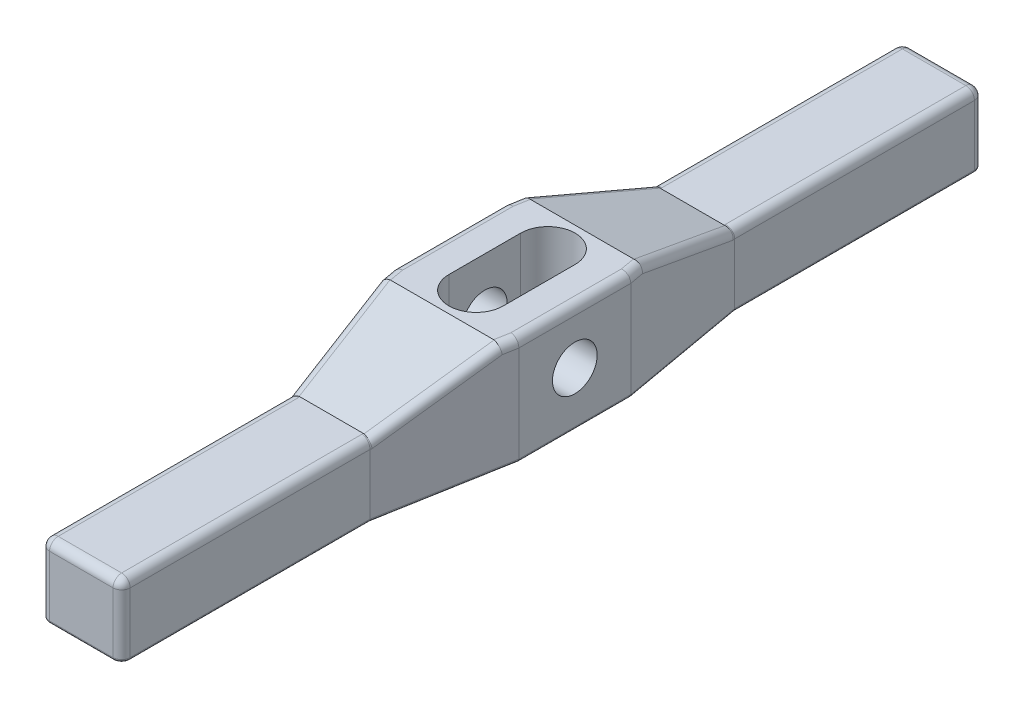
ISO-10303-21;
HEADER;
FILE_DESCRIPTION(('STEP AP214'),'2;1');
FILE_NAME('part.step','',(''),(''),'','','');
FILE_SCHEMA(('AUTOMOTIVE_DESIGN { 1 0 10303 214 1 1 1 1 }'));
ENDSEC;
DATA;
#1=APPLICATION_CONTEXT('core data for automotive mechanical design processes');
#2=APPLICATION_PROTOCOL_DEFINITION('international standard','automotive_design',2000,#1);
#3=PRODUCT_CONTEXT('',#1,'mechanical');
#4=PRODUCT('Part','Part','',(#3));
#5=PRODUCT_RELATED_PRODUCT_CATEGORY('part','',(#4));
#6=PRODUCT_DEFINITION_FORMATION('','',#4);
#7=PRODUCT_DEFINITION_CONTEXT('part definition',#1,'design');
#8=PRODUCT_DEFINITION('design','',#6,#7);
#9=PRODUCT_DEFINITION_SHAPE('','',#8);
#10=(LENGTH_UNIT() NAMED_UNIT(*) SI_UNIT(.MILLI.,.METRE.));
#11=(NAMED_UNIT(*) PLANE_ANGLE_UNIT() SI_UNIT($,.RADIAN.));
#12=(NAMED_UNIT(*) SI_UNIT($,.STERADIAN.) SOLID_ANGLE_UNIT());
#13=UNCERTAINTY_MEASURE_WITH_UNIT(LENGTH_MEASURE(1.E-05),#10,'distance_accuracy_value','');
#14=(GEOMETRIC_REPRESENTATION_CONTEXT(3) GLOBAL_UNCERTAINTY_ASSIGNED_CONTEXT((#13)) GLOBAL_UNIT_ASSIGNED_CONTEXT((#10,
#11,#12)) REPRESENTATION_CONTEXT('',''));
#15=CARTESIAN_POINT('',(0.,0.,0.));
#16=DIRECTION('',(0.,0.,1.));
#17=DIRECTION('',(1.,0.,0.));
#18=AXIS2_PLACEMENT_3D('',#15,#16,#17);
#19=CARTESIAN_POINT('',(7.13740000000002,19.05,76.2));
#20=DIRECTION('',(0.,1.,0.));
#21=DIRECTION('',(0.,0.,1.));
#22=AXIS2_PLACEMENT_3D('',#19,#20,#21);
#23=PLANE('',#22);
#24=DIRECTION('',(1.,0.,0.));
#25=VECTOR('',#24,1.);
#26=CARTESIAN_POINT('',(-11.1125,19.05,-12.3698));
#27=LINE('',#26,#25);
#28=CARTESIAN_POINT('',(-9.12594732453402,19.05,-12.3698));
#29=VERTEX_POINT('',#28);
#30=CARTESIAN_POINT('',(9.12594732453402,19.05,-12.3698));
#31=VERTEX_POINT('',#30);
#32=EDGE_CURVE('E895',#29,#31,#27,.T.);
#33=ORIENTED_EDGE('',*,*,#32,.F.);
#34=DIRECTION('',(-0.175070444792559,0.,0.984555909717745));
#35=VECTOR('',#34,1.);
#36=CARTESIAN_POINT('',(-9.61203679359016,19.05,-9.63614464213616));
#37=LINE('',#36,#35);
#38=CARTESIAN_POINT('',(-9.5885,19.05,-9.76851015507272));
#39=VERTEX_POINT('',#38);
#40=EDGE_CURVE('E597',#29,#39,#37,.T.);
#41=ORIENTED_EDGE('',*,*,#40,.T.);
#42=DIRECTION('',(0.,0.,1.));
#43=VECTOR('',#42,1.);
#44=CARTESIAN_POINT('',(-9.5885,19.05,9.90295199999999));
#45=LINE('',#44,#43);
#46=CARTESIAN_POINT('',(-9.5885,19.05,9.76851015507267));
#47=VERTEX_POINT('',#46);
#48=EDGE_CURVE('E593',#39,#47,#45,.T.);
#49=ORIENTED_EDGE('',*,*,#48,.T.);
#50=DIRECTION('',(0.175070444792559,0.,0.984555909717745));
#51=VECTOR('',#50,1.);
#52=CARTESIAN_POINT('',(-9.17339011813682,19.05,12.1029926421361));
#53=LINE('',#52,#51);
#54=CARTESIAN_POINT('',(-9.12594732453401,19.05,12.3698));
#55=VERTEX_POINT('',#54);
#56=EDGE_CURVE('E595',#47,#55,#53,.T.);
#57=ORIENTED_EDGE('',*,*,#56,.T.);
#58=DIRECTION('',(1.,0.,0.));
#59=VECTOR('',#58,1.);
#60=CARTESIAN_POINT('',(-11.1125,19.05,12.3698));
#61=LINE('',#60,#59);
#62=CARTESIAN_POINT('',(9.12594732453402,19.05,12.3698));
#63=VERTEX_POINT('',#62);
#64=EDGE_CURVE('E898',#55,#63,#61,.T.);
#65=ORIENTED_EDGE('',*,*,#64,.T.);
#66=DIRECTION('',(0.175070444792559,0.,-0.984555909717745));
#67=VECTOR('',#66,1.);
#68=CARTESIAN_POINT('',(9.61203679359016,19.05,9.63614464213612));
#69=LINE('',#68,#67);
#70=CARTESIAN_POINT('',(9.5885,19.05,9.76851015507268));
#71=VERTEX_POINT('',#70);
#72=EDGE_CURVE('E591',#63,#71,#69,.T.);
#73=ORIENTED_EDGE('',*,*,#72,.T.);
#74=DIRECTION('',(0.,0.,-1.));
#75=VECTOR('',#74,1.);
#76=CARTESIAN_POINT('',(9.5885,19.05,-9.90295199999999));
#77=LINE('',#76,#75);
#78=CARTESIAN_POINT('',(9.5885,19.05,-9.7685101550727));
#79=VERTEX_POINT('',#78);
#80=EDGE_CURVE('E589',#71,#79,#77,.T.);
#81=ORIENTED_EDGE('',*,*,#80,.T.);
#82=DIRECTION('',(-0.175070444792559,0.,-0.984555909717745));
#83=VECTOR('',#82,1.);
#84=CARTESIAN_POINT('',(9.17339011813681,19.05,-12.1029926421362));
#85=LINE('',#84,#83);
#86=EDGE_CURVE('E587',#79,#31,#85,.T.);
#87=ORIENTED_EDGE('',*,*,#86,.T.);
#88=EDGE_LOOP('',(#33,#41,#49,#57,#65,#73,#81,#87));
#89=FACE_BOUND('',#88,.T.);
#90=DIRECTION('',(0.,0.,1.));
#91=VECTOR('',#90,1.);
#92=CARTESIAN_POINT('',(-4.8133,19.05,-6.35));
#93=LINE('',#92,#91);
#94=CARTESIAN_POINT('',(-4.8133,19.05,-6.35));
#95=VERTEX_POINT('',#94);
#96=CARTESIAN_POINT('',(-4.8133,19.05,6.35));
#97=VERTEX_POINT('',#96);
#98=EDGE_CURVE('E340',#95,#97,#93,.T.);
#99=ORIENTED_EDGE('',*,*,#98,.F.);
#100=CARTESIAN_POINT('',(0.,19.05,-6.35));
#101=DIRECTION('',(0.,1.,0.));
#102=DIRECTION('',(0.,0.,1.));
#103=AXIS2_PLACEMENT_3D('',#100,#101,#102);
#104=CIRCLE('',#103,4.8133);
#105=CARTESIAN_POINT('',(4.8133,19.05,-6.35));
#106=VERTEX_POINT('',#105);
#107=EDGE_CURVE('E330',#106,#95,#104,.T.);
#108=ORIENTED_EDGE('',*,*,#107,.F.);
#109=DIRECTION('',(0.,0.,-1.));
#110=VECTOR('',#109,1.);
#111=CARTESIAN_POINT('',(4.8133,19.05,-6.35));
#112=LINE('',#111,#110);
#113=CARTESIAN_POINT('',(4.8133,19.05,6.34999999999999));
#114=VERTEX_POINT('',#113);
#115=EDGE_CURVE('E355',#114,#106,#112,.T.);
#116=ORIENTED_EDGE('',*,*,#115,.F.);
#117=CARTESIAN_POINT('',(0.,19.05,6.35));
#118=DIRECTION('',(0.,1.,0.));
#119=DIRECTION('',(0.,0.,1.));
#120=AXIS2_PLACEMENT_3D('',#117,#118,#119);
#121=CIRCLE('',#120,4.8133);
#122=EDGE_CURVE('E353',#97,#114,#121,.T.);
#123=ORIENTED_EDGE('',*,*,#122,.F.);
#124=EDGE_LOOP('',(#99,#108,#116,#123));
#125=FACE_BOUND('',#124,.T.);
#126=ADVANCED_FACE('F34',(#89,#125),#23,.T.);
#127=CARTESIAN_POINT('',(7.13740000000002,0.,76.2));
#128=DIRECTION('',(0.,1.,0.));
#129=DIRECTION('',(0.,0.,1.));
#130=AXIS2_PLACEMENT_3D('',#127,#128,#129);
#131=PLANE('',#130);
#132=DIRECTION('',(0.,0.,1.));
#133=VECTOR('',#132,1.);
#134=CARTESIAN_POINT('',(-10.6045,0.,76.2));
#135=LINE('',#134,#133);
#136=CARTESIAN_POINT('',(-10.6045,0.,9.8581380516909));
#137=VERTEX_POINT('',#136);
#138=CARTESIAN_POINT('',(-10.6045,0.,-9.8581380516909));
#139=VERTEX_POINT('',#138);
#140=EDGE_CURVE('E445',#137,#139,#135,.F.);
#141=ORIENTED_EDGE('',*,*,#140,.T.);
#142=DIRECTION('',(-0.175070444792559,0.,0.984555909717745));
#143=VECTOR('',#142,1.);
#144=CARTESIAN_POINT('',(-24.8942689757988,0.,70.5042355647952));
#145=LINE('',#144,#143);
#146=CARTESIAN_POINT('',(-6.62940000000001,0.,-32.2131860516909));
#147=VERTEX_POINT('',#146);
#148=EDGE_CURVE('E447',#139,#147,#145,.F.);
#149=ORIENTED_EDGE('',*,*,#148,.T.);
#150=DIRECTION('',(0.,0.,1.));
#151=VECTOR('',#150,1.);
#152=CARTESIAN_POINT('',(-6.62940000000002,0.,76.2));
#153=LINE('',#152,#151);
#154=CARTESIAN_POINT('',(-6.6294,0.,-74.676));
#155=VERTEX_POINT('',#154);
#156=EDGE_CURVE('E432',#147,#155,#153,.F.);
#157=ORIENTED_EDGE('',*,*,#156,.T.);
#158=CARTESIAN_POINT('',(-5.6134,0.,-74.676));
#159=DIRECTION('',(0.,1.,0.));
#160=DIRECTION('',(0.,0.,1.));
#161=AXIS2_PLACEMENT_3D('',#158,#159,#160);
#162=CIRCLE('',#161,1.016);
#163=CARTESIAN_POINT('',(-5.6134,0.,-75.692));
#164=VERTEX_POINT('',#163);
#165=EDGE_CURVE('E430',#155,#164,#162,.F.);
#166=ORIENTED_EDGE('',*,*,#165,.T.);
#167=DIRECTION('',(-1.,0.,0.));
#168=VECTOR('',#167,1.);
#169=CARTESIAN_POINT('',(7.13740000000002,0.,-75.692));
#170=LINE('',#169,#168);
#171=CARTESIAN_POINT('',(5.6134,0.,-75.692));
#172=VERTEX_POINT('',#171);
#173=EDGE_CURVE('E428',#164,#172,#170,.F.);
#174=ORIENTED_EDGE('',*,*,#173,.T.);
#175=CARTESIAN_POINT('',(5.6134,0.,-74.676));
#176=DIRECTION('',(0.,1.,0.));
#177=DIRECTION('',(0.,0.,1.));
#178=AXIS2_PLACEMENT_3D('',#175,#176,#177);
#179=CIRCLE('',#178,1.016);
#180=CARTESIAN_POINT('',(6.6294,0.,-74.676));
#181=VERTEX_POINT('',#180);
#182=EDGE_CURVE('E426',#172,#181,#179,.F.);
#183=ORIENTED_EDGE('',*,*,#182,.T.);
#184=DIRECTION('',(0.,0.,-1.));
#185=VECTOR('',#184,1.);
#186=CARTESIAN_POINT('',(6.62940000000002,0.,76.2));
#187=LINE('',#186,#185);
#188=CARTESIAN_POINT('',(6.62940000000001,0.,-32.2131860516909));
#189=VERTEX_POINT('',#188);
#190=EDGE_CURVE('E416',#181,#189,#187,.F.);
#191=ORIENTED_EDGE('',*,*,#190,.T.);
#192=DIRECTION('',(-0.175070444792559,0.,-0.984555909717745));
#193=VECTOR('',#192,1.);
#194=CARTESIAN_POINT('',(25.3317867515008,0.,72.9647348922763));
#195=LINE('',#194,#193);
#196=CARTESIAN_POINT('',(10.6045,0.,-9.8581380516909));
#197=VERTEX_POINT('',#196);
#198=EDGE_CURVE('E418',#189,#197,#195,.F.);
#199=ORIENTED_EDGE('',*,*,#198,.T.);
#200=DIRECTION('',(0.,0.,-1.));
#201=VECTOR('',#200,1.);
#202=CARTESIAN_POINT('',(10.6045,0.,76.2));
#203=LINE('',#202,#201);
#204=CARTESIAN_POINT('',(10.6045,0.,9.8581380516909));
#205=VERTEX_POINT('',#204);
#206=EDGE_CURVE('E420',#197,#205,#203,.F.);
#207=ORIENTED_EDGE('',*,*,#206,.T.);
#208=DIRECTION('',(0.175070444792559,0.,-0.984555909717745));
#209=VECTOR('',#208,1.);
#210=CARTESIAN_POINT('',(-0.93688934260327,0.,74.7642568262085));
#211=LINE('',#210,#209);
#212=CARTESIAN_POINT('',(6.62940000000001,0.,32.2131860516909));
#213=VERTEX_POINT('',#212);
#214=EDGE_CURVE('E422',#205,#213,#211,.F.);
#215=ORIENTED_EDGE('',*,*,#214,.T.);
#216=DIRECTION('',(0.,0.,-1.));
#217=VECTOR('',#216,1.);
#218=CARTESIAN_POINT('',(6.6294,0.,76.2));
#219=LINE('',#218,#217);
#220=CARTESIAN_POINT('',(6.6294,0.,74.676));
#221=VERTEX_POINT('',#220);
#222=EDGE_CURVE('E424',#213,#221,#219,.F.);
#223=ORIENTED_EDGE('',*,*,#222,.T.);
#224=CARTESIAN_POINT('',(5.6134,0.,74.676));
#225=DIRECTION('',(0.,1.,0.));
#226=DIRECTION('',(0.,0.,1.));
#227=AXIS2_PLACEMENT_3D('',#224,#225,#226);
#228=CIRCLE('',#227,1.016);
#229=CARTESIAN_POINT('',(5.6134,0.,75.692));
#230=VERTEX_POINT('',#229);
#231=EDGE_CURVE('E434',#221,#230,#228,.F.);
#232=ORIENTED_EDGE('',*,*,#231,.T.);
#233=DIRECTION('',(1.,0.,0.));
#234=VECTOR('',#233,1.);
#235=CARTESIAN_POINT('',(7.13740000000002,0.,75.692));
#236=LINE('',#235,#234);
#237=CARTESIAN_POINT('',(-5.6134,0.,75.692));
#238=VERTEX_POINT('',#237);
#239=EDGE_CURVE('E436',#230,#238,#236,.F.);
#240=ORIENTED_EDGE('',*,*,#239,.T.);
#241=CARTESIAN_POINT('',(-5.6134,0.,74.676));
#242=DIRECTION('',(0.,1.,0.));
#243=DIRECTION('',(0.,0.,1.));
#244=AXIS2_PLACEMENT_3D('',#241,#242,#243);
#245=CIRCLE('',#244,1.016);
#246=CARTESIAN_POINT('',(-6.6294,0.,74.676));
#247=VERTEX_POINT('',#246);
#248=EDGE_CURVE('E438',#238,#247,#245,.F.);
#249=ORIENTED_EDGE('',*,*,#248,.T.);
#250=DIRECTION('',(0.,0.,1.));
#251=VECTOR('',#250,1.);
#252=CARTESIAN_POINT('',(-6.6294,0.,76.2));
#253=LINE('',#252,#251);
#254=CARTESIAN_POINT('',(-6.62940000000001,0.,32.2131860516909));
#255=VERTEX_POINT('',#254);
#256=EDGE_CURVE('E440',#247,#255,#253,.F.);
#257=ORIENTED_EDGE('',*,*,#256,.T.);
#258=DIRECTION('',(0.175070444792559,0.,0.984555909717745));
#259=VECTOR('',#258,1.);
#260=CARTESIAN_POINT('',(1.3744071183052,0.,77.2247561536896));
#261=LINE('',#260,#259);
#262=EDGE_CURVE('E443',#255,#137,#261,.F.);
#263=ORIENTED_EDGE('',*,*,#262,.T.);
#264=EDGE_LOOP('',(#141,#149,#157,#166,#174,#183,#191,#199,#207,#215,#223,#232,#240,#249,#257,#263));
#265=FACE_BOUND('',#264,.T.);
#266=CARTESIAN_POINT('',(0.,0.,-6.35));
#267=DIRECTION('',(0.,1.,0.));
#268=DIRECTION('',(0.,0.,1.));
#269=AXIS2_PLACEMENT_3D('',#266,#267,#268);
#270=CIRCLE('',#269,4.8133);
#271=CARTESIAN_POINT('',(4.8133,0.,-6.34999999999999));
#272=VERTEX_POINT('',#271);
#273=CARTESIAN_POINT('',(-4.8133,0.,-6.35));
#274=VERTEX_POINT('',#273);
#275=EDGE_CURVE('E360',#272,#274,#270,.T.);
#276=ORIENTED_EDGE('',*,*,#275,.T.);
#277=DIRECTION('',(0.,0.,1.));
#278=VECTOR('',#277,1.);
#279=CARTESIAN_POINT('',(-4.8133,0.,-6.35));
#280=LINE('',#279,#278);
#281=CARTESIAN_POINT('',(-4.8133,0.,6.35));
#282=VERTEX_POINT('',#281);
#283=EDGE_CURVE('E347',#274,#282,#280,.T.);
#284=ORIENTED_EDGE('',*,*,#283,.T.);
#285=CARTESIAN_POINT('',(0.,0.,6.35));
#286=DIRECTION('',(0.,1.,0.));
#287=DIRECTION('',(0.,0.,1.));
#288=AXIS2_PLACEMENT_3D('',#285,#286,#287);
#289=CIRCLE('',#288,4.8133);
#290=CARTESIAN_POINT('',(4.8133,0.,6.35));
#291=VERTEX_POINT('',#290);
#292=EDGE_CURVE('E364',#282,#291,#289,.T.);
#293=ORIENTED_EDGE('',*,*,#292,.T.);
#294=DIRECTION('',(0.,0.,-1.));
#295=VECTOR('',#294,1.);
#296=CARTESIAN_POINT('',(4.8133,0.,-6.35));
#297=LINE('',#296,#295);
#298=EDGE_CURVE('E341',#291,#272,#297,.T.);
#299=ORIENTED_EDGE('',*,*,#298,.T.);
#300=EDGE_LOOP('',(#276,#284,#293,#299));
#301=FACE_BOUND('',#300,.T.);
#302=ADVANCED_FACE('F738',(#265,#301),#131,.F.);
#303=CARTESIAN_POINT('',(7.1374,19.05,-76.2));
#304=DIRECTION('',(-1.,0.,0.));
#305=DIRECTION('',(0.,0.,1.));
#306=AXIS2_PLACEMENT_3D('',#303,#304,#305);
#307=PLANE('',#306);
#308=DIRECTION('',(0.,-1.,0.));
#309=VECTOR('',#308,1.);
#310=CARTESIAN_POINT('',(7.1374,19.05,-74.676));
#311=LINE('',#310,#309);
#312=CARTESIAN_POINT('',(7.1374,0.508000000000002,-74.676));
#313=VERTEX_POINT('',#312);
#314=CARTESIAN_POINT('',(7.1374,11.176,-74.676));
#315=VERTEX_POINT('',#314);
#316=EDGE_CURVE('E400',#313,#315,#311,.F.);
#317=ORIENTED_EDGE('',*,*,#316,.T.);
#318=DIRECTION('',(0.,0.,1.));
#319=VECTOR('',#318,1.);
#320=CARTESIAN_POINT('',(7.1374,11.176,-76.2));
#321=LINE('',#320,#319);
#322=CARTESIAN_POINT('',(7.13740000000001,11.176,-32.258));
#323=VERTEX_POINT('',#322);
#324=EDGE_CURVE('E632',#315,#323,#321,.T.);
#325=ORIENTED_EDGE('',*,*,#324,.T.);
#326=DIRECTION('',(0.,-1.,0.));
#327=VECTOR('',#326,1.);
#328=CARTESIAN_POINT('',(7.13740000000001,19.05,-32.258));
#329=LINE('',#328,#327);
#330=CARTESIAN_POINT('',(7.13740000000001,0.508000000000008,-32.258));
#331=VERTEX_POINT('',#330);
#332=EDGE_CURVE('E348',#323,#331,#329,.T.);
#333=ORIENTED_EDGE('',*,*,#332,.T.);
#334=DIRECTION('',(0.,0.,-1.));
#335=VECTOR('',#334,1.);
#336=CARTESIAN_POINT('',(7.1374,0.508000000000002,-76.2));
#337=LINE('',#336,#335);
#338=EDGE_CURVE('E489',#331,#313,#337,.T.);
#339=ORIENTED_EDGE('',*,*,#338,.T.);
#340=EDGE_LOOP('',(#317,#325,#333,#339));
#341=FACE_BOUND('',#340,.T.);
#342=ADVANCED_FACE('F723',(#341),#307,.F.);
#343=CARTESIAN_POINT('',(-7.1374,19.05,-76.2));
#344=DIRECTION('',(0.,0.,1.));
#345=DIRECTION('',(1.,0.,0.));
#346=AXIS2_PLACEMENT_3D('',#343,#344,#345);
#347=PLANE('',#346);
#348=DIRECTION('',(0.,-1.,0.));
#349=VECTOR('',#348,1.);
#350=CARTESIAN_POINT('',(-5.6134,19.05,-76.2));
#351=LINE('',#350,#349);
#352=CARTESIAN_POINT('',(-5.6134,0.508000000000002,-76.2));
#353=VERTEX_POINT('',#352);
#354=CARTESIAN_POINT('',(-5.6134,11.176,-76.2));
#355=VERTEX_POINT('',#354);
#356=EDGE_CURVE('E397',#353,#355,#351,.F.);
#357=ORIENTED_EDGE('',*,*,#356,.T.);
#358=DIRECTION('',(1.,0.,0.));
#359=VECTOR('',#358,1.);
#360=CARTESIAN_POINT('',(-7.1374,11.176,-76.2));
#361=LINE('',#360,#359);
#362=CARTESIAN_POINT('',(5.6134,11.176,-76.2));
#363=VERTEX_POINT('',#362);
#364=EDGE_CURVE('E570',#355,#363,#361,.T.);
#365=ORIENTED_EDGE('',*,*,#364,.T.);
#366=DIRECTION('',(0.,-1.,0.));
#367=VECTOR('',#366,1.);
#368=CARTESIAN_POINT('',(5.6134,19.05,-76.2));
#369=LINE('',#368,#367);
#370=CARTESIAN_POINT('',(5.6134,0.508000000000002,-76.2));
#371=VERTEX_POINT('',#370);
#372=EDGE_CURVE('E395',#363,#371,#369,.T.);
#373=ORIENTED_EDGE('',*,*,#372,.T.);
#374=DIRECTION('',(-1.,0.,0.));
#375=VECTOR('',#374,1.);
#376=CARTESIAN_POINT('',(-7.1374,0.508000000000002,-76.2));
#377=LINE('',#376,#375);
#378=EDGE_CURVE('E463',#371,#353,#377,.T.);
#379=ORIENTED_EDGE('',*,*,#378,.T.);
#380=EDGE_LOOP('',(#357,#365,#373,#379));
#381=FACE_BOUND('',#380,.T.);
#382=ADVANCED_FACE('F753',(#381),#347,.F.);
#383=CARTESIAN_POINT('',(-7.1374,19.05,-76.2));
#384=DIRECTION('',(1.,0.,0.));
#385=DIRECTION('',(0.,0.,-1.));
#386=AXIS2_PLACEMENT_3D('',#383,#384,#385);
#387=PLANE('',#386);
#388=DIRECTION('',(0.,-1.,0.));
#389=VECTOR('',#388,1.);
#390=CARTESIAN_POINT('',(-7.13740000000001,19.05,-32.258));
#391=LINE('',#390,#389);
#392=CARTESIAN_POINT('',(-7.13740000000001,11.176,-32.258));
#393=VERTEX_POINT('',#392);
#394=CARTESIAN_POINT('',(-7.13740000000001,0.508000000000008,-32.258));
#395=VERTEX_POINT('',#394);
#396=EDGE_CURVE('E386',#393,#395,#391,.T.);
#397=ORIENTED_EDGE('',*,*,#396,.F.);
#398=DIRECTION('',(0.,0.,-1.));
#399=VECTOR('',#398,1.);
#400=CARTESIAN_POINT('',(-7.1374,11.176,-76.2));
#401=LINE('',#400,#399);
#402=CARTESIAN_POINT('',(-7.1374,11.176,-74.676));
#403=VERTEX_POINT('',#402);
#404=EDGE_CURVE('E556',#393,#403,#401,.T.);
#405=ORIENTED_EDGE('',*,*,#404,.T.);
#406=DIRECTION('',(0.,-1.,0.));
#407=VECTOR('',#406,1.);
#408=CARTESIAN_POINT('',(-7.1374,19.05,-74.676));
#409=LINE('',#408,#407);
#410=CARTESIAN_POINT('',(-7.1374,0.508000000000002,-74.676));
#411=VERTEX_POINT('',#410);
#412=EDGE_CURVE('E388',#403,#411,#409,.T.);
#413=ORIENTED_EDGE('',*,*,#412,.T.);
#414=DIRECTION('',(0.,0.,1.));
#415=VECTOR('',#414,1.);
#416=CARTESIAN_POINT('',(-7.1374,0.508000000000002,-76.2));
#417=LINE('',#416,#415);
#418=EDGE_CURVE('E457',#411,#395,#417,.T.);
#419=ORIENTED_EDGE('',*,*,#418,.T.);
#420=EDGE_LOOP('',(#397,#405,#413,#419));
#421=FACE_BOUND('',#420,.T.);
#422=ADVANCED_FACE('F962',(#421),#387,.F.);
#423=CARTESIAN_POINT('',(-7.13740000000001,19.05,-32.258));
#424=DIRECTION('',(0.984555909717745,0.,0.175070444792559));
#425=DIRECTION('',(0.175070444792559,0.,-0.984555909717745));
#426=AXIS2_PLACEMENT_3D('',#423,#424,#425);
#427=PLANE('',#426);
#428=DIRECTION('',(0.166746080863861,-0.304690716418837,-0.937741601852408));
#429=VECTOR('',#428,1.);
#430=CARTESIAN_POINT('',(-7.54272024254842,11.812825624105,-29.978572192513));
#431=LINE('',#430,#429);
#432=CARTESIAN_POINT('',(-10.6693315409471,17.526,-12.3952294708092));
#433=VERTEX_POINT('',#432);
#434=CARTESIAN_POINT('',(-7.19420887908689,11.176,-31.9385199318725));
#435=VERTEX_POINT('',#434);
#436=EDGE_CURVE('E576',#433,#435,#431,.T.);
#437=ORIENTED_EDGE('',*,*,#436,.T.);
#438=DIRECTION('',(0.175070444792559,0.,-0.984555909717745));
#439=VECTOR('',#438,1.);
#440=CARTESIAN_POINT('',(-7.13740000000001,11.176,-32.258));
#441=LINE('',#440,#439);
#442=EDGE_CURVE('E578',#435,#393,#441,.T.);
#443=ORIENTED_EDGE('',*,*,#442,.T.);
#444=ORIENTED_EDGE('',*,*,#396,.T.);
#445=DIRECTION('',(-0.175070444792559,0.,0.984555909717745));
#446=VECTOR('',#445,1.);
#447=CARTESIAN_POINT('',(-7.13740000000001,0.508000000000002,-32.258));
#448=LINE('',#447,#446);
#449=CARTESIAN_POINT('',(-11.1125,0.508000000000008,-9.902952));
#450=VERTEX_POINT('',#449);
#451=EDGE_CURVE('E468',#395,#450,#448,.T.);
#452=ORIENTED_EDGE('',*,*,#451,.T.);
#453=DIRECTION('',(0.,-1.,0.));
#454=VECTOR('',#453,1.);
#455=CARTESIAN_POINT('',(-11.1125,19.05,-9.902952));
#456=LINE('',#455,#454);
#457=CARTESIAN_POINT('',(-11.1125,17.526,-9.902952));
#458=VERTEX_POINT('',#457);
#459=EDGE_CURVE('E384',#458,#450,#456,.T.);
#460=ORIENTED_EDGE('',*,*,#459,.F.);
#461=DIRECTION('',(-0.175070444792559,0.,0.984555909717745));
#462=VECTOR('',#461,1.);
#463=CARTESIAN_POINT('',(-10.6738533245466,17.526,-12.3698));
#464=LINE('',#463,#462);
#465=EDGE_CURVE('E574',#458,#433,#464,.F.);
#466=ORIENTED_EDGE('',*,*,#465,.T.);
#467=EDGE_LOOP('',(#437,#443,#444,#452,#460,#466));
#468=FACE_BOUND('',#467,.T.);
#469=ADVANCED_FACE('F877',(#468),#427,.F.);
#470=CARTESIAN_POINT('',(-11.1125,19.05,-9.902952));
#471=DIRECTION('',(1.,0.,0.));
#472=DIRECTION('',(0.,0.,-1.));
#473=AXIS2_PLACEMENT_3D('',#470,#471,#472);
#474=PLANE('',#473);
#475=CARTESIAN_POINT('',(-11.1125,9.525,0.));
#476=DIRECTION('',(1.,0.,0.));
#477=DIRECTION('',(0.,0.,-1.));
#478=AXIS2_PLACEMENT_3D('',#475,#476,#477);
#479=CIRCLE('',#478,3.95605);
#480=CARTESIAN_POINT('',(-11.1125,9.525,-3.95605));
#481=VERTEX_POINT('',#480);
#482=EDGE_CURVE('E393',#481,#481,#479,.T.);
#483=ORIENTED_EDGE('',*,*,#482,.T.);
#484=EDGE_LOOP('',(#483));
#485=FACE_BOUND('',#484,.T.);
#486=DIRECTION('',(0.,-1.,0.));
#487=VECTOR('',#486,1.);
#488=CARTESIAN_POINT('',(-11.1125,19.05,9.902952));
#489=LINE('',#488,#487);
#490=CARTESIAN_POINT('',(-11.1125,17.526,9.902952));
#491=VERTEX_POINT('',#490);
#492=CARTESIAN_POINT('',(-11.1125,0.508000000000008,9.902952));
#493=VERTEX_POINT('',#492);
#494=EDGE_CURVE('E382',#491,#493,#489,.T.);
#495=ORIENTED_EDGE('',*,*,#494,.F.);
#496=DIRECTION('',(0.,0.,1.));
#497=VECTOR('',#496,1.);
#498=CARTESIAN_POINT('',(-11.1125,17.526,-9.90295199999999));
#499=LINE('',#498,#497);
#500=EDGE_CURVE('E612',#491,#458,#499,.F.);
#501=ORIENTED_EDGE('',*,*,#500,.T.);
#502=ORIENTED_EDGE('',*,*,#459,.T.);
#503=DIRECTION('',(0.,0.,1.));
#504=VECTOR('',#503,1.);
#505=CARTESIAN_POINT('',(-11.1125,0.508000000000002,-9.902952));
#506=LINE('',#505,#504);
#507=EDGE_CURVE('E471',#450,#493,#506,.T.);
#508=ORIENTED_EDGE('',*,*,#507,.T.);
#509=EDGE_LOOP('',(#495,#501,#502,#508));
#510=FACE_BOUND('',#509,.T.);
#511=ADVANCED_FACE('F874',(#485,#510),#474,.F.);
#512=CARTESIAN_POINT('',(-7.13740000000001,19.05,32.258));
#513=DIRECTION('',(0.984555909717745,0.,-0.175070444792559));
#514=DIRECTION('',(-0.175070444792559,0.,-0.984555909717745));
#515=AXIS2_PLACEMENT_3D('',#512,#513,#514);
#516=PLANE('',#515);
#517=DIRECTION('',(-0.166746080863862,0.30469071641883,-0.93774160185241));
#518=VECTOR('',#517,1.);
#519=CARTESIAN_POINT('',(-7.5427202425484,11.8128256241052,29.9785721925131));
#520=LINE('',#519,#518);
#521=CARTESIAN_POINT('',(-7.19420887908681,11.176,31.938519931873));
#522=VERTEX_POINT('',#521);
#523=CARTESIAN_POINT('',(-10.6693315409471,17.526,12.3952294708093));
#524=VERTEX_POINT('',#523);
#525=EDGE_CURVE('E608',#522,#524,#520,.T.);
#526=ORIENTED_EDGE('',*,*,#525,.T.);
#527=DIRECTION('',(0.175070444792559,0.,0.984555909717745));
#528=VECTOR('',#527,1.);
#529=CARTESIAN_POINT('',(-11.1125,17.526,9.90295199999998));
#530=LINE('',#529,#528);
#531=EDGE_CURVE('E610',#524,#491,#530,.F.);
#532=ORIENTED_EDGE('',*,*,#531,.T.);
#533=ORIENTED_EDGE('',*,*,#494,.T.);
#534=DIRECTION('',(0.175070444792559,0.,0.984555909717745));
#535=VECTOR('',#534,1.);
#536=CARTESIAN_POINT('',(-7.13740000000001,0.508000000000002,32.258));
#537=LINE('',#536,#535);
#538=CARTESIAN_POINT('',(-7.13740000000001,0.508000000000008,32.258));
#539=VERTEX_POINT('',#538);
#540=EDGE_CURVE('E474',#493,#539,#537,.T.);
#541=ORIENTED_EDGE('',*,*,#540,.T.);
#542=DIRECTION('',(0.,-1.,0.));
#543=VECTOR('',#542,1.);
#544=CARTESIAN_POINT('',(-7.13740000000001,19.05,32.258));
#545=LINE('',#544,#543);
#546=CARTESIAN_POINT('',(-7.13740000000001,11.176,32.258));
#547=VERTEX_POINT('',#546);
#548=EDGE_CURVE('E380',#547,#539,#545,.T.);
#549=ORIENTED_EDGE('',*,*,#548,.F.);
#550=DIRECTION('',(-0.175070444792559,0.,-0.984555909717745));
#551=VECTOR('',#550,1.);
#552=CARTESIAN_POINT('',(-7.13740000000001,11.176,32.258));
#553=LINE('',#552,#551);
#554=EDGE_CURVE('E606',#547,#522,#553,.T.);
#555=ORIENTED_EDGE('',*,*,#554,.T.);
#556=EDGE_LOOP('',(#526,#532,#533,#541,#549,#555));
#557=FACE_BOUND('',#556,.T.);
#558=ADVANCED_FACE('F848',(#557),#516,.F.);
#559=CARTESIAN_POINT('',(-7.1374,19.05,76.2));
#560=DIRECTION('',(1.,0.,0.));
#561=DIRECTION('',(0.,0.,-1.));
#562=AXIS2_PLACEMENT_3D('',#559,#560,#561);
#563=PLANE('',#562);
#564=DIRECTION('',(0.,-1.,0.));
#565=VECTOR('',#564,1.);
#566=CARTESIAN_POINT('',(-7.1374,19.05,74.676));
#567=LINE('',#566,#565);
#568=CARTESIAN_POINT('',(-7.1374,0.508000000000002,74.676));
#569=VERTEX_POINT('',#568);
#570=CARTESIAN_POINT('',(-7.1374,11.176,74.676));
#571=VERTEX_POINT('',#570);
#572=EDGE_CURVE('E410',#569,#571,#567,.F.);
#573=ORIENTED_EDGE('',*,*,#572,.T.);
#574=DIRECTION('',(0.,0.,-1.));
#575=VECTOR('',#574,1.);
#576=CARTESIAN_POINT('',(-7.1374,11.176,76.2));
#577=LINE('',#576,#575);
#578=EDGE_CURVE('E614',#571,#547,#577,.T.);
#579=ORIENTED_EDGE('',*,*,#578,.T.);
#580=ORIENTED_EDGE('',*,*,#548,.T.);
#581=DIRECTION('',(0.,0.,1.));
#582=VECTOR('',#581,1.);
#583=CARTESIAN_POINT('',(-7.1374,0.508000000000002,76.2));
#584=LINE('',#583,#582);
#585=EDGE_CURVE('E413',#539,#569,#584,.T.);
#586=ORIENTED_EDGE('',*,*,#585,.T.);
#587=EDGE_LOOP('',(#573,#579,#580,#586));
#588=FACE_BOUND('',#587,.T.);
#589=ADVANCED_FACE('F827',(#588),#563,.F.);
#590=CARTESIAN_POINT('',(-7.1374,19.05,76.2));
#591=DIRECTION('',(0.,0.,-1.));
#592=DIRECTION('',(-1.,0.,0.));
#593=AXIS2_PLACEMENT_3D('',#590,#591,#592);
#594=PLANE('',#593);
#595=DIRECTION('',(0.,-1.,0.));
#596=VECTOR('',#595,1.);
#597=CARTESIAN_POINT('',(5.6134,19.05,76.2));
#598=LINE('',#597,#596);
#599=CARTESIAN_POINT('',(5.6134,0.508000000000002,76.2));
#600=VERTEX_POINT('',#599);
#601=CARTESIAN_POINT('',(5.6134,11.176,76.2));
#602=VERTEX_POINT('',#601);
#603=EDGE_CURVE('E407',#600,#602,#598,.F.);
#604=ORIENTED_EDGE('',*,*,#603,.T.);
#605=DIRECTION('',(1.,0.,0.));
#606=VECTOR('',#605,1.);
#607=CARTESIAN_POINT('',(-7.1374,11.176,76.2));
#608=LINE('',#607,#606);
#609=CARTESIAN_POINT('',(-5.6134,11.176,76.2));
#610=VERTEX_POINT('',#609);
#611=EDGE_CURVE('E552',#602,#610,#608,.F.);
#612=ORIENTED_EDGE('',*,*,#611,.T.);
#613=DIRECTION('',(0.,-1.,0.));
#614=VECTOR('',#613,1.);
#615=CARTESIAN_POINT('',(-5.6134,19.05,76.2));
#616=LINE('',#615,#614);
#617=CARTESIAN_POINT('',(-5.6134,0.508000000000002,76.2));
#618=VERTEX_POINT('',#617);
#619=EDGE_CURVE('E405',#610,#618,#616,.T.);
#620=ORIENTED_EDGE('',*,*,#619,.T.);
#621=DIRECTION('',(1.,0.,0.));
#622=VECTOR('',#621,1.);
#623=CARTESIAN_POINT('',(-7.1374,0.508000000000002,76.2));
#624=LINE('',#623,#622);
#625=EDGE_CURVE('E452',#618,#600,#624,.T.);
#626=ORIENTED_EDGE('',*,*,#625,.T.);
#627=EDGE_LOOP('',(#604,#612,#620,#626));
#628=FACE_BOUND('',#627,.T.);
#629=ADVANCED_FACE('F949',(#628),#594,.F.);
#630=CARTESIAN_POINT('',(7.1374,19.05,76.2));
#631=DIRECTION('',(-1.,0.,0.));
#632=DIRECTION('',(0.,0.,1.));
#633=AXIS2_PLACEMENT_3D('',#630,#631,#632);
#634=PLANE('',#633);
#635=DIRECTION('',(0.,-1.,0.));
#636=VECTOR('',#635,1.);
#637=CARTESIAN_POINT('',(7.13740000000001,19.05,32.258));
#638=LINE('',#637,#636);
#639=CARTESIAN_POINT('',(7.13740000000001,11.176,32.258));
#640=VERTEX_POINT('',#639);
#641=CARTESIAN_POINT('',(7.13740000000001,0.508000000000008,32.258));
#642=VERTEX_POINT('',#641);
#643=EDGE_CURVE('E378',#640,#642,#638,.T.);
#644=ORIENTED_EDGE('',*,*,#643,.F.);
#645=DIRECTION('',(0.,0.,1.));
#646=VECTOR('',#645,1.);
#647=CARTESIAN_POINT('',(7.1374,11.176,76.2));
#648=LINE('',#647,#646);
#649=CARTESIAN_POINT('',(7.1374,11.176,74.676));
#650=VERTEX_POINT('',#649);
#651=EDGE_CURVE('E616',#640,#650,#648,.T.);
#652=ORIENTED_EDGE('',*,*,#651,.T.);
#653=DIRECTION('',(0.,-1.,0.));
#654=VECTOR('',#653,1.);
#655=CARTESIAN_POINT('',(7.1374,19.05,74.676));
#656=LINE('',#655,#654);
#657=CARTESIAN_POINT('',(7.1374,0.508000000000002,74.676));
#658=VERTEX_POINT('',#657);
#659=EDGE_CURVE('E403',#650,#658,#656,.T.);
#660=ORIENTED_EDGE('',*,*,#659,.T.);
#661=DIRECTION('',(0.,0.,-1.));
#662=VECTOR('',#661,1.);
#663=CARTESIAN_POINT('',(7.1374,0.508000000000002,76.2));
#664=LINE('',#663,#662);
#665=EDGE_CURVE('E477',#658,#642,#664,.T.);
#666=ORIENTED_EDGE('',*,*,#665,.T.);
#667=EDGE_LOOP('',(#644,#652,#660,#666));
#668=FACE_BOUND('',#667,.T.);
#669=ADVANCED_FACE('F945',(#668),#634,.F.);
#670=CARTESIAN_POINT('',(7.13740000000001,19.05,32.258));
#671=DIRECTION('',(-0.984555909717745,0.,-0.175070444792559));
#672=DIRECTION('',(-0.175070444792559,0.,0.984555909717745));
#673=AXIS2_PLACEMENT_3D('',#670,#671,#672);
#674=PLANE('',#673);
#675=DIRECTION('',(-0.166746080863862,-0.30469071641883,0.93774160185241));
#676=VECTOR('',#675,1.);
#677=CARTESIAN_POINT('',(7.5427202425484,11.8128256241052,29.9785721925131));
#678=LINE('',#677,#676);
#679=CARTESIAN_POINT('',(10.6693315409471,17.526,12.3952294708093));
#680=VERTEX_POINT('',#679);
#681=CARTESIAN_POINT('',(7.19420887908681,11.176,31.938519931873));
#682=VERTEX_POINT('',#681);
#683=EDGE_CURVE('E620',#680,#682,#678,.T.);
#684=ORIENTED_EDGE('',*,*,#683,.T.);
#685=DIRECTION('',(-0.175070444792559,0.,0.984555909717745));
#686=VECTOR('',#685,1.);
#687=CARTESIAN_POINT('',(7.13740000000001,11.176,32.258));
#688=LINE('',#687,#686);
#689=EDGE_CURVE('E622',#682,#640,#688,.T.);
#690=ORIENTED_EDGE('',*,*,#689,.T.);
#691=ORIENTED_EDGE('',*,*,#643,.T.);
#692=DIRECTION('',(0.175070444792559,0.,-0.984555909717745));
#693=VECTOR('',#692,1.);
#694=CARTESIAN_POINT('',(7.13740000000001,0.508000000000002,32.258));
#695=LINE('',#694,#693);
#696=CARTESIAN_POINT('',(11.1125,0.508000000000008,9.902952));
#697=VERTEX_POINT('',#696);
#698=EDGE_CURVE('E480',#642,#697,#695,.T.);
#699=ORIENTED_EDGE('',*,*,#698,.T.);
#700=DIRECTION('',(0.,-1.,0.));
#701=VECTOR('',#700,1.);
#702=CARTESIAN_POINT('',(11.1125,19.05,9.902952));
#703=LINE('',#702,#701);
#704=CARTESIAN_POINT('',(11.1125,17.526,9.902952));
#705=VERTEX_POINT('',#704);
#706=EDGE_CURVE('E376',#705,#697,#703,.T.);
#707=ORIENTED_EDGE('',*,*,#706,.F.);
#708=DIRECTION('',(0.175070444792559,0.,-0.984555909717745));
#709=VECTOR('',#708,1.);
#710=CARTESIAN_POINT('',(10.6738533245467,17.526,12.3698));
#711=LINE('',#710,#709);
#712=EDGE_CURVE('E618',#705,#680,#711,.F.);
#713=ORIENTED_EDGE('',*,*,#712,.T.);
#714=EDGE_LOOP('',(#684,#690,#691,#699,#707,#713));
#715=FACE_BOUND('',#714,.T.);
#716=ADVANCED_FACE('F941',(#715),#674,.F.);
#717=CARTESIAN_POINT('',(11.1125,19.05,-9.902952));
#718=DIRECTION('',(-1.,0.,0.));
#719=DIRECTION('',(0.,0.,1.));
#720=AXIS2_PLACEMENT_3D('',#717,#718,#719);
#721=PLANE('',#720);
#722=CARTESIAN_POINT('',(11.1125,9.525,0.));
#723=DIRECTION('',(1.,0.,0.));
#724=DIRECTION('',(0.,0.,-1.));
#725=AXIS2_PLACEMENT_3D('',#722,#723,#724);
#726=CIRCLE('',#725,3.95605);
#727=CARTESIAN_POINT('',(11.1125,9.525,-3.95605));
#728=VERTEX_POINT('',#727);
#729=EDGE_CURVE('E538',#728,#728,#726,.T.);
#730=ORIENTED_EDGE('',*,*,#729,.F.);
#731=EDGE_LOOP('',(#730));
#732=FACE_BOUND('',#731,.T.);
#733=DIRECTION('',(0.,-1.,0.));
#734=VECTOR('',#733,1.);
#735=CARTESIAN_POINT('',(11.1125,19.05,-9.902952));
#736=LINE('',#735,#734);
#737=CARTESIAN_POINT('',(11.1125,17.526,-9.902952));
#738=VERTEX_POINT('',#737);
#739=CARTESIAN_POINT('',(11.1125,0.508000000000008,-9.902952));
#740=VERTEX_POINT('',#739);
#741=EDGE_CURVE('E374',#738,#740,#736,.T.);
#742=ORIENTED_EDGE('',*,*,#741,.F.);
#743=DIRECTION('',(0.,0.,-1.));
#744=VECTOR('',#743,1.);
#745=CARTESIAN_POINT('',(11.1125,17.526,9.90295199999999));
#746=LINE('',#745,#744);
#747=EDGE_CURVE('E624',#738,#705,#746,.F.);
#748=ORIENTED_EDGE('',*,*,#747,.T.);
#749=ORIENTED_EDGE('',*,*,#706,.T.);
#750=DIRECTION('',(0.,0.,-1.));
#751=VECTOR('',#750,1.);
#752=CARTESIAN_POINT('',(11.1125,0.508000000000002,-9.902952));
#753=LINE('',#752,#751);
#754=EDGE_CURVE('E483',#697,#740,#753,.T.);
#755=ORIENTED_EDGE('',*,*,#754,.T.);
#756=EDGE_LOOP('',(#742,#748,#749,#755));
#757=FACE_BOUND('',#756,.T.);
#758=ADVANCED_FACE('F788',(#732,#757),#721,.F.);
#759=CARTESIAN_POINT('',(7.13740000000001,19.05,-32.258));
#760=DIRECTION('',(-0.984555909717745,0.,0.175070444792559));
#761=DIRECTION('',(0.175070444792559,0.,0.984555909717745));
#762=AXIS2_PLACEMENT_3D('',#759,#760,#761);
#763=PLANE('',#762);
#764=DIRECTION('',(0.166746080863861,0.304690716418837,0.937741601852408));
#765=VECTOR('',#764,1.);
#766=CARTESIAN_POINT('',(7.54272024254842,11.812825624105,-29.978572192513));
#767=LINE('',#766,#765);
#768=CARTESIAN_POINT('',(7.19420887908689,11.176,-31.9385199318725));
#769=VERTEX_POINT('',#768);
#770=CARTESIAN_POINT('',(10.6693315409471,17.526,-12.3952294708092));
#771=VERTEX_POINT('',#770);
#772=EDGE_CURVE('E626',#769,#771,#767,.T.);
#773=ORIENTED_EDGE('',*,*,#772,.T.);
#774=DIRECTION('',(-0.175070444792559,0.,-0.984555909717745));
#775=VECTOR('',#774,1.);
#776=CARTESIAN_POINT('',(11.1125,17.526,-9.90295200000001));
#777=LINE('',#776,#775);
#778=EDGE_CURVE('E630',#771,#738,#777,.F.);
#779=ORIENTED_EDGE('',*,*,#778,.T.);
#780=ORIENTED_EDGE('',*,*,#741,.T.);
#781=DIRECTION('',(-0.175070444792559,0.,-0.984555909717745));
#782=VECTOR('',#781,1.);
#783=CARTESIAN_POINT('',(7.13740000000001,0.508000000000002,-32.258));
#784=LINE('',#783,#782);
#785=EDGE_CURVE('E486',#740,#331,#784,.T.);
#786=ORIENTED_EDGE('',*,*,#785,.T.);
#787=ORIENTED_EDGE('',*,*,#332,.F.);
#788=DIRECTION('',(0.175070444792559,0.,0.984555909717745));
#789=VECTOR('',#788,1.);
#790=CARTESIAN_POINT('',(7.13740000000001,11.176,-32.258));
#791=LINE('',#790,#789);
#792=EDGE_CURVE('E628',#323,#769,#791,.T.);
#793=ORIENTED_EDGE('',*,*,#792,.T.);
#794=EDGE_LOOP('',(#773,#779,#780,#786,#787,#793));
#795=FACE_BOUND('',#794,.T.);
#796=ADVANCED_FACE('F781',(#795),#763,.F.);
#797=CARTESIAN_POINT('',(0.,19.05,-6.35));
#798=DIRECTION('',(0.,-1.,0.));
#799=DIRECTION('',(0.,0.,-1.));
#800=AXIS2_PLACEMENT_3D('',#797,#798,#799);
#801=CYLINDRICAL_SURFACE('',#800,4.8133);
#802=ORIENTED_EDGE('',*,*,#275,.F.);
#803=DIRECTION('',(0.,-1.,0.));
#804=VECTOR('',#803,1.);
#805=CARTESIAN_POINT('',(4.8133,19.05,-6.35));
#806=LINE('',#805,#804);
#807=EDGE_CURVE('E336',#106,#272,#806,.T.);
#808=ORIENTED_EDGE('',*,*,#807,.F.);
#809=ORIENTED_EDGE('',*,*,#107,.T.);
#810=DIRECTION('',(0.,-1.,0.));
#811=VECTOR('',#810,1.);
#812=CARTESIAN_POINT('',(-4.8133,19.05,-6.35));
#813=LINE('',#812,#811);
#814=EDGE_CURVE('E333',#95,#274,#813,.T.);
#815=ORIENTED_EDGE('',*,*,#814,.T.);
#816=EDGE_LOOP('',(#802,#808,#809,#815));
#817=FACE_BOUND('',#816,.T.);
#818=ADVANCED_FACE('F332',(#817),#801,.F.);
#819=CARTESIAN_POINT('',(-4.8133,19.05,-6.35));
#820=DIRECTION('',(1.,0.,0.));
#821=DIRECTION('',(0.,0.,-1.));
#822=AXIS2_PLACEMENT_3D('',#819,#820,#821);
#823=PLANE('',#822);
#824=CARTESIAN_POINT('',(-4.8133,9.525,0.));
#825=DIRECTION('',(1.,0.,0.));
#826=DIRECTION('',(0.,0.,-1.));
#827=AXIS2_PLACEMENT_3D('',#824,#825,#826);
#828=CIRCLE('',#827,3.95605);
#829=CARTESIAN_POINT('',(-4.8133,9.525,-3.95605));
#830=VERTEX_POINT('',#829);
#831=EDGE_CURVE('E392',#830,#830,#828,.T.);
#832=ORIENTED_EDGE('',*,*,#831,.F.);
#833=EDGE_LOOP('',(#832));
#834=FACE_BOUND('',#833,.T.);
#835=ORIENTED_EDGE('',*,*,#283,.F.);
#836=ORIENTED_EDGE('',*,*,#814,.F.);
#837=ORIENTED_EDGE('',*,*,#98,.T.);
#838=DIRECTION('',(0.,-1.,0.));
#839=VECTOR('',#838,1.);
#840=CARTESIAN_POINT('',(-4.8133,19.05,6.35));
#841=LINE('',#840,#839);
#842=EDGE_CURVE('E349',#97,#282,#841,.T.);
#843=ORIENTED_EDGE('',*,*,#842,.T.);
#844=EDGE_LOOP('',(#835,#836,#837,#843));
#845=FACE_BOUND('',#844,.T.);
#846=ADVANCED_FACE('F344',(#834,#845),#823,.T.);
#847=CARTESIAN_POINT('',(0.,19.05,6.35));
#848=DIRECTION('',(0.,-1.,0.));
#849=DIRECTION('',(0.,0.,-1.));
#850=AXIS2_PLACEMENT_3D('',#847,#848,#849);
#851=CYLINDRICAL_SURFACE('',#850,4.8133);
#852=ORIENTED_EDGE('',*,*,#292,.F.);
#853=ORIENTED_EDGE('',*,*,#842,.F.);
#854=ORIENTED_EDGE('',*,*,#122,.T.);
#855=DIRECTION('',(0.,-1.,0.));
#856=VECTOR('',#855,1.);
#857=CARTESIAN_POINT('',(4.8133,19.05,6.35));
#858=LINE('',#857,#856);
#859=EDGE_CURVE('E370',#114,#291,#858,.T.);
#860=ORIENTED_EDGE('',*,*,#859,.T.);
#861=EDGE_LOOP('',(#852,#853,#854,#860));
#862=FACE_BOUND('',#861,.T.);
#863=ADVANCED_FACE('F1301',(#862),#851,.F.);
#864=CARTESIAN_POINT('',(4.8133,19.05,-6.35));
#865=DIRECTION('',(-1.,0.,0.));
#866=DIRECTION('',(0.,0.,1.));
#867=AXIS2_PLACEMENT_3D('',#864,#865,#866);
#868=PLANE('',#867);
#869=CARTESIAN_POINT('',(4.8133,9.525,0.));
#870=DIRECTION('',(-1.,0.,0.));
#871=DIRECTION('',(0.,0.,1.));
#872=AXIS2_PLACEMENT_3D('',#869,#870,#871);
#873=CIRCLE('',#872,3.95605);
#874=CARTESIAN_POINT('',(4.8133,9.525,3.95605));
#875=VERTEX_POINT('',#874);
#876=EDGE_CURVE('E389',#875,#875,#873,.T.);
#877=ORIENTED_EDGE('',*,*,#876,.F.);
#878=EDGE_LOOP('',(#877));
#879=FACE_BOUND('',#878,.T.);
#880=ORIENTED_EDGE('',*,*,#298,.F.);
#881=ORIENTED_EDGE('',*,*,#859,.F.);
#882=ORIENTED_EDGE('',*,*,#115,.T.);
#883=ORIENTED_EDGE('',*,*,#807,.T.);
#884=EDGE_LOOP('',(#880,#881,#882,#883));
#885=FACE_BOUND('',#884,.T.);
#886=ADVANCED_FACE('F1201',(#879,#885),#868,.T.);
#887=CARTESIAN_POINT('',(-11.1125,12.7,-31.9130904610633));
#888=DIRECTION('',(0.,-1.,0.));
#889=DIRECTION('',(0.,0.,-1.));
#890=AXIS2_PLACEMENT_3D('',#887,#888,#889);
#891=PLANE('',#890);
#892=DIRECTION('',(0.,0.,-1.));
#893=VECTOR('',#892,1.);
#894=CARTESIAN_POINT('',(-5.61340000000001,12.7,-31.9130904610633));
#895=LINE('',#894,#893);
#896=CARTESIAN_POINT('',(-5.6134,12.7,-74.676));
#897=VERTEX_POINT('',#896);
#898=CARTESIAN_POINT('',(-5.61340000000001,12.7,-32.1235581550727));
#899=VERTEX_POINT('',#898);
#900=EDGE_CURVE('E564',#897,#899,#895,.F.);
#901=ORIENTED_EDGE('',*,*,#900,.T.);
#902=DIRECTION('',(0.175070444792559,0.,-0.984555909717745));
#903=VECTOR('',#902,1.);
#904=CARTESIAN_POINT('',(-5.81822315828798,12.7,-30.9716798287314));
#905=LINE('',#904,#903);
#906=CARTESIAN_POINT('',(-5.65082466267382,12.7,-31.9130904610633));
#907=VERTEX_POINT('',#906);
#908=EDGE_CURVE('E566',#899,#907,#905,.F.);
#909=ORIENTED_EDGE('',*,*,#908,.T.);
#910=DIRECTION('',(1.,0.,0.));
#911=VECTOR('',#910,1.);
#912=CARTESIAN_POINT('',(-11.1125,12.7,-31.9130904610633));
#913=LINE('',#912,#911);
#914=CARTESIAN_POINT('',(5.65082466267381,12.7,-31.9130904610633));
#915=VERTEX_POINT('',#914);
#916=EDGE_CURVE('E362',#907,#915,#913,.T.);
#917=ORIENTED_EDGE('',*,*,#916,.T.);
#918=DIRECTION('',(0.175070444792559,0.,0.984555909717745));
#919=VECTOR('',#918,1.);
#920=CARTESIAN_POINT('',(5.137034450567,12.7,-34.8025284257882));
#921=LINE('',#920,#919);
#922=CARTESIAN_POINT('',(5.61340000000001,12.7,-32.1235581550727));
#923=VERTEX_POINT('',#922);
#924=EDGE_CURVE('E560',#915,#923,#921,.F.);
#925=ORIENTED_EDGE('',*,*,#924,.T.);
#926=DIRECTION('',(0.,0.,1.));
#927=VECTOR('',#926,1.);
#928=CARTESIAN_POINT('',(5.6134,12.7,-31.9130904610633));
#929=LINE('',#928,#927);
#930=CARTESIAN_POINT('',(5.6134,12.7,-74.676));
#931=VERTEX_POINT('',#930);
#932=EDGE_CURVE('E558',#923,#931,#929,.F.);
#933=ORIENTED_EDGE('',*,*,#932,.T.);
#934=DIRECTION('',(1.,0.,0.));
#935=VECTOR('',#934,1.);
#936=CARTESIAN_POINT('',(-11.1125,12.7,-74.676));
#937=LINE('',#936,#935);
#938=EDGE_CURVE('E562',#931,#897,#937,.F.);
#939=ORIENTED_EDGE('',*,*,#938,.T.);
#940=EDGE_LOOP('',(#901,#909,#917,#925,#933,#939));
#941=FACE_BOUND('',#940,.T.);
#942=ADVANCED_FACE('F769',(#941),#891,.F.);
#943=CARTESIAN_POINT('',(-11.1125,19.05,-12.3698));
#944=DIRECTION('',(0.,-0.951056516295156,0.309016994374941));
#945=DIRECTION('',(0.,-0.309016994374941,-0.951056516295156));
#946=AXIS2_PLACEMENT_3D('',#943,#944,#945);
#947=PLANE('',#946);
#948=CARTESIAN_POINT('',(-4.81679522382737,11.176,-36.6034801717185));
#949=DIRECTION('',(0.,-0.951056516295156,0.309016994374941));
#950=DIRECTION('',(0.183782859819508,-0.303753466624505,-0.934857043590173));
#951=AXIS2_PLACEMENT_3D('',#948,#949,#950);
#952=ELLIPSE('',#951,5.00912903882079,1.524);
#953=CARTESIAN_POINT('',(-5.73334457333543,12.6977681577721,-31.9199593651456));
#954=VERTEX_POINT('',#953);
#955=EDGE_CURVE('E634',#907,#954,#952,.T.);
#956=ORIENTED_EDGE('',*,*,#955,.T.);
#957=DIRECTION('',(0.166746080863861,-0.304690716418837,-0.937741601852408));
#958=VECTOR('',#957,1.);
#959=CARTESIAN_POINT('',(-9.26259489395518,19.146674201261,-12.0722674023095));
#960=LINE('',#959,#958);
#961=CARTESIAN_POINT('',(-9.20846723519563,19.0477681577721,-12.3766689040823));
#962=VERTEX_POINT('',#961);
#963=EDGE_CURVE('E585',#954,#962,#960,.F.);
#964=ORIENTED_EDGE('',*,*,#963,.T.);
#965=CARTESIAN_POINT('',(-8.29191788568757,17.526,-17.0601897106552));
#966=DIRECTION('',(0.,-0.951056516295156,0.309016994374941));
#967=DIRECTION('',(0.183782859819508,-0.303753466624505,-0.934857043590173));
#968=AXIS2_PLACEMENT_3D('',#965,#966,#967);
#969=ELLIPSE('',#968,5.00912903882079,1.524);
#970=EDGE_CURVE('E583',#962,#29,#969,.F.);
#971=ORIENTED_EDGE('',*,*,#970,.T.);
#972=ORIENTED_EDGE('',*,*,#32,.T.);
#973=CARTESIAN_POINT('',(8.29191788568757,17.526,-17.0601897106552));
#974=DIRECTION('',(0.,-0.951056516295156,0.309016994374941));
#975=DIRECTION('',(0.183782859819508,0.303753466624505,0.934857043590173));
#976=AXIS2_PLACEMENT_3D('',#973,#974,#975);
#977=ELLIPSE('',#976,5.00912903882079,1.524);
#978=CARTESIAN_POINT('',(9.20846723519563,19.0477681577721,-12.3766689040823));
#979=VERTEX_POINT('',#978);
#980=EDGE_CURVE('E581',#31,#979,#977,.F.);
#981=ORIENTED_EDGE('',*,*,#980,.T.);
#982=DIRECTION('',(0.166746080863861,0.304690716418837,0.937741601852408));
#983=VECTOR('',#982,1.);
#984=CARTESIAN_POINT('',(8.64464531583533,18.0175112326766,-15.5474736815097));
#985=LINE('',#984,#983);
#986=CARTESIAN_POINT('',(5.73334457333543,12.6977681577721,-31.9199593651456));
#987=VERTEX_POINT('',#986);
#988=EDGE_CURVE('E50',#979,#987,#985,.F.);
#989=ORIENTED_EDGE('',*,*,#988,.T.);
#990=CARTESIAN_POINT('',(4.81679522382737,11.176,-36.6034801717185));
#991=DIRECTION('',(0.,-0.951056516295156,0.309016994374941));
#992=DIRECTION('',(0.183782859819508,0.303753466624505,0.934857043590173));
#993=AXIS2_PLACEMENT_3D('',#990,#991,#992);
#994=ELLIPSE('',#993,5.00912903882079,1.524);
#995=EDGE_CURVE('E11',#987,#915,#994,.T.);
#996=ORIENTED_EDGE('',*,*,#995,.T.);
#997=ORIENTED_EDGE('',*,*,#916,.F.);
#998=EDGE_LOOP('',(#956,#964,#971,#972,#981,#989,#996,#997));
#999=FACE_BOUND('',#998,.T.);
#1000=ADVANCED_FACE('F894',(#999),#947,.F.);
#1001=CARTESIAN_POINT('',(-11.1125,12.7,31.9130904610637));
#1002=DIRECTION('',(0.,-1.,0.));
#1003=DIRECTION('',(0.,0.,-1.));
#1004=AXIS2_PLACEMENT_3D('',#1001,#1002,#1003);
#1005=PLANE('',#1004);
#1006=DIRECTION('',(1.,0.,0.));
#1007=VECTOR('',#1006,1.);
#1008=CARTESIAN_POINT('',(-11.1125,12.7,31.9130904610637));
#1009=LINE('',#1008,#1007);
#1010=CARTESIAN_POINT('',(-5.65082466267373,12.7,31.9130904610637));
#1011=VERTEX_POINT('',#1010);
#1012=CARTESIAN_POINT('',(5.65082466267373,12.7,31.9130904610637));
#1013=VERTEX_POINT('',#1012);
#1014=EDGE_CURVE('E900',#1011,#1013,#1009,.T.);
#1015=ORIENTED_EDGE('',*,*,#1014,.F.);
#1016=DIRECTION('',(-0.175070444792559,0.,-0.984555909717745));
#1017=VECTOR('',#1016,1.);
#1018=CARTESIAN_POINT('',(-5.8182231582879,12.7,30.9716798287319));
#1019=LINE('',#1018,#1017);
#1020=CARTESIAN_POINT('',(-5.61340000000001,12.7,32.1235581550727));
#1021=VERTEX_POINT('',#1020);
#1022=EDGE_CURVE('E550',#1011,#1021,#1019,.F.);
#1023=ORIENTED_EDGE('',*,*,#1022,.T.);
#1024=DIRECTION('',(0.,0.,-1.));
#1025=VECTOR('',#1024,1.);
#1026=CARTESIAN_POINT('',(-5.61340000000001,12.7,31.9130904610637));
#1027=LINE('',#1026,#1025);
#1028=CARTESIAN_POINT('',(-5.6134,12.7,74.676));
#1029=VERTEX_POINT('',#1028);
#1030=EDGE_CURVE('E548',#1021,#1029,#1027,.F.);
#1031=ORIENTED_EDGE('',*,*,#1030,.T.);
#1032=DIRECTION('',(1.,0.,0.));
#1033=VECTOR('',#1032,1.);
#1034=CARTESIAN_POINT('',(-11.1125,12.7,74.676));
#1035=LINE('',#1034,#1033);
#1036=CARTESIAN_POINT('',(5.6134,12.7,74.676));
#1037=VERTEX_POINT('',#1036);
#1038=EDGE_CURVE('E545',#1029,#1037,#1035,.T.);
#1039=ORIENTED_EDGE('',*,*,#1038,.T.);
#1040=DIRECTION('',(0.,0.,1.));
#1041=VECTOR('',#1040,1.);
#1042=CARTESIAN_POINT('',(5.6134,12.7,31.9130904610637));
#1043=LINE('',#1042,#1041);
#1044=CARTESIAN_POINT('',(5.61340000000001,12.7,32.1235581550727));
#1045=VERTEX_POINT('',#1044);
#1046=EDGE_CURVE('E543',#1037,#1045,#1043,.F.);
#1047=ORIENTED_EDGE('',*,*,#1046,.T.);
#1048=DIRECTION('',(-0.175070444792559,0.,0.984555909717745));
#1049=VECTOR('',#1048,1.);
#1050=CARTESIAN_POINT('',(5.13703445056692,12.7,34.8025284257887));
#1051=LINE('',#1050,#1049);
#1052=EDGE_CURVE('E541',#1045,#1013,#1051,.F.);
#1053=ORIENTED_EDGE('',*,*,#1052,.T.);
#1054=EDGE_LOOP('',(#1015,#1023,#1031,#1039,#1047,#1053));
#1055=FACE_BOUND('',#1054,.T.);
#1056=ADVANCED_FACE('F1175',(#1055),#1005,.F.);
#1057=CARTESIAN_POINT('',(-11.1125,19.05,12.3698));
#1058=DIRECTION('',(0.,-0.951056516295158,-0.309016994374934));
#1059=DIRECTION('',(0.,0.309016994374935,-0.951056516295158));
#1060=AXIS2_PLACEMENT_3D('',#1057,#1058,#1059);
#1061=PLANE('',#1060);
#1062=ORIENTED_EDGE('',*,*,#64,.F.);
#1063=CARTESIAN_POINT('',(-8.29191788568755,17.526,17.0601897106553));
#1064=DIRECTION('',(0.,-0.951056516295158,-0.309016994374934));
#1065=DIRECTION('',(-0.183782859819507,0.303753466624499,-0.934857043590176));
#1066=AXIS2_PLACEMENT_3D('',#1063,#1064,#1065);
#1067=ELLIPSE('',#1066,5.0091290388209,1.524);
#1068=CARTESIAN_POINT('',(-9.20846723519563,19.0477681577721,12.3766689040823));
#1069=VERTEX_POINT('',#1068);
#1070=EDGE_CURVE('E604',#55,#1069,#1067,.F.);
#1071=ORIENTED_EDGE('',*,*,#1070,.T.);
#1072=DIRECTION('',(-0.166746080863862,0.30469071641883,-0.93774160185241));
#1073=VECTOR('',#1072,1.);
#1074=CARTESIAN_POINT('',(-9.26259489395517,19.146674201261,12.0722674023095));
#1075=LINE('',#1074,#1073);
#1076=CARTESIAN_POINT('',(-5.73334457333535,12.6977681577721,31.9199593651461));
#1077=VERTEX_POINT('',#1076);
#1078=EDGE_CURVE('E602',#1069,#1077,#1075,.F.);
#1079=ORIENTED_EDGE('',*,*,#1078,.T.);
#1080=CARTESIAN_POINT('',(-4.81679522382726,11.176,36.603480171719));
#1081=DIRECTION('',(0.,-0.951056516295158,-0.309016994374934));
#1082=DIRECTION('',(-0.183782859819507,0.303753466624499,-0.934857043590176));
#1083=AXIS2_PLACEMENT_3D('',#1080,#1081,#1082);
#1084=ELLIPSE('',#1083,5.0091290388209,1.524);
#1085=EDGE_CURVE('E637',#1077,#1011,#1084,.T.);
#1086=ORIENTED_EDGE('',*,*,#1085,.T.);
#1087=ORIENTED_EDGE('',*,*,#1014,.T.);
#1088=CARTESIAN_POINT('',(4.81679522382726,11.176,36.603480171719));
#1089=DIRECTION('',(0.,-0.951056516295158,-0.309016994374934));
#1090=DIRECTION('',(-0.183782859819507,-0.303753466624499,0.934857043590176));
#1091=AXIS2_PLACEMENT_3D('',#1088,#1089,#1090);
#1092=ELLIPSE('',#1091,5.0091290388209,1.524);
#1093=CARTESIAN_POINT('',(5.73334457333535,12.6977681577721,31.9199593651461));
#1094=VERTEX_POINT('',#1093);
#1095=EDGE_CURVE('E43',#1013,#1094,#1092,.T.);
#1096=ORIENTED_EDGE('',*,*,#1095,.T.);
#1097=DIRECTION('',(-0.166746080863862,-0.30469071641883,0.93774160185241));
#1098=VECTOR('',#1097,1.);
#1099=CARTESIAN_POINT('',(8.64464531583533,18.0175112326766,15.5474736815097));
#1100=LINE('',#1099,#1098);
#1101=CARTESIAN_POINT('',(9.20846723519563,19.0477681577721,12.3766689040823));
#1102=VERTEX_POINT('',#1101);
#1103=EDGE_CURVE('E58',#1094,#1102,#1100,.F.);
#1104=ORIENTED_EDGE('',*,*,#1103,.T.);
#1105=CARTESIAN_POINT('',(8.29191788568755,17.526,17.0601897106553));
#1106=DIRECTION('',(0.,-0.951056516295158,-0.309016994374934));
#1107=DIRECTION('',(-0.183782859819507,-0.303753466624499,0.934857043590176));
#1108=AXIS2_PLACEMENT_3D('',#1105,#1106,#1107);
#1109=ELLIPSE('',#1108,5.0091290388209,1.524);
#1110=EDGE_CURVE('E599',#1102,#63,#1109,.F.);
#1111=ORIENTED_EDGE('',*,*,#1110,.T.);
#1112=EDGE_LOOP('',(#1062,#1071,#1079,#1086,#1087,#1096,#1104,#1111));
#1113=FACE_BOUND('',#1112,.T.);
#1114=ADVANCED_FACE('F923',(#1113),#1061,.F.);
#1115=CARTESIAN_POINT('',(-11.1125,9.525,0.));
#1116=DIRECTION('',(1.,0.,0.));
#1117=DIRECTION('',(0.,0.,-1.));
#1118=AXIS2_PLACEMENT_3D('',#1115,#1116,#1117);
#1119=CYLINDRICAL_SURFACE('',#1118,3.95605);
#1120=ORIENTED_EDGE('',*,*,#876,.T.);
#1121=EDGE_LOOP('',(#1120));
#1122=FACE_BOUND('',#1121,.T.);
#1123=ORIENTED_EDGE('',*,*,#729,.T.);
#1124=EDGE_LOOP('',(#1123));
#1125=FACE_BOUND('',#1124,.T.);
#1126=ADVANCED_FACE('F915',(#1122,#1125),#1119,.F.);
#1127=ORIENTED_EDGE('',*,*,#831,.T.);
#1128=EDGE_LOOP('',(#1127));
#1129=FACE_BOUND('',#1128,.T.);
#1130=ORIENTED_EDGE('',*,*,#482,.F.);
#1131=EDGE_LOOP('',(#1130));
#1132=FACE_BOUND('',#1131,.T.);
#1133=ADVANCED_FACE('F913',(#1129,#1132),#1119,.F.);
#1134=CARTESIAN_POINT('',(-5.6134,19.05,-74.676));
#1135=DIRECTION('',(0.,-1.,0.));
#1136=DIRECTION('',(0.,0.,-1.));
#1137=AXIS2_PLACEMENT_3D('',#1134,#1135,#1136);
#1138=CYLINDRICAL_SURFACE('',#1137,1.524);
#1139=ORIENTED_EDGE('',*,*,#412,.F.);
#1140=CARTESIAN_POINT('',(-5.6134,11.176,-74.676));
#1141=DIRECTION('',(0.,-1.,0.));
#1142=DIRECTION('',(0.,0.,-1.));
#1143=AXIS2_PLACEMENT_3D('',#1140,#1141,#1142);
#1144=CIRCLE('',#1143,1.524);
#1145=EDGE_CURVE('E568',#403,#355,#1144,.T.);
#1146=ORIENTED_EDGE('',*,*,#1145,.T.);
#1147=ORIENTED_EDGE('',*,*,#356,.F.);
#1148=CARTESIAN_POINT('',(-5.6134,0.508000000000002,-74.676));
#1149=DIRECTION('',(0.,1.,0.));
#1150=DIRECTION('',(0.,0.,1.));
#1151=AXIS2_PLACEMENT_3D('',#1148,#1149,#1150);
#1152=CIRCLE('',#1151,1.524);
#1153=EDGE_CURVE('E460',#353,#411,#1152,.T.);
#1154=ORIENTED_EDGE('',*,*,#1153,.T.);
#1155=EDGE_LOOP('',(#1139,#1146,#1147,#1154));
#1156=FACE_BOUND('',#1155,.T.);
#1157=ADVANCED_FACE('F756',(#1156),#1138,.T.);
#1158=CARTESIAN_POINT('',(5.6134,19.05,-74.676));
#1159=DIRECTION('',(0.,-1.,0.));
#1160=DIRECTION('',(0.,0.,-1.));
#1161=AXIS2_PLACEMENT_3D('',#1158,#1159,#1160);
#1162=CYLINDRICAL_SURFACE('',#1161,1.524);
#1163=ORIENTED_EDGE('',*,*,#372,.F.);
#1164=CARTESIAN_POINT('',(5.6134,11.176,-74.676));
#1165=DIRECTION('',(0.,-1.,0.));
#1166=DIRECTION('',(0.,0.,-1.));
#1167=AXIS2_PLACEMENT_3D('',#1164,#1165,#1166);
#1168=CIRCLE('',#1167,1.524);
#1169=EDGE_CURVE('E572',#363,#315,#1168,.T.);
#1170=ORIENTED_EDGE('',*,*,#1169,.T.);
#1171=ORIENTED_EDGE('',*,*,#316,.F.);
#1172=CARTESIAN_POINT('',(5.6134,0.508000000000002,-74.676));
#1173=DIRECTION('',(0.,1.,0.));
#1174=DIRECTION('',(0.,0.,1.));
#1175=AXIS2_PLACEMENT_3D('',#1172,#1173,#1174);
#1176=CIRCLE('',#1175,1.524);
#1177=EDGE_CURVE('E465',#313,#371,#1176,.T.);
#1178=ORIENTED_EDGE('',*,*,#1177,.T.);
#1179=EDGE_LOOP('',(#1163,#1170,#1171,#1178));
#1180=FACE_BOUND('',#1179,.T.);
#1181=ADVANCED_FACE('F720',(#1180),#1162,.T.);
#1182=CARTESIAN_POINT('',(5.6134,19.05,74.676));
#1183=DIRECTION('',(0.,-1.,0.));
#1184=DIRECTION('',(0.,0.,-1.));
#1185=AXIS2_PLACEMENT_3D('',#1182,#1183,#1184);
#1186=CYLINDRICAL_SURFACE('',#1185,1.524);
#1187=ORIENTED_EDGE('',*,*,#659,.F.);
#1188=CARTESIAN_POINT('',(5.6134,11.176,74.676));
#1189=DIRECTION('',(0.,-1.,0.));
#1190=DIRECTION('',(0.,0.,-1.));
#1191=AXIS2_PLACEMENT_3D('',#1188,#1189,#1190);
#1192=CIRCLE('',#1191,1.524);
#1193=EDGE_CURVE('E554',#650,#602,#1192,.T.);
#1194=ORIENTED_EDGE('',*,*,#1193,.T.);
#1195=ORIENTED_EDGE('',*,*,#603,.F.);
#1196=CARTESIAN_POINT('',(5.6134,0.508000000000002,74.676));
#1197=DIRECTION('',(0.,1.,0.));
#1198=DIRECTION('',(0.,0.,1.));
#1199=AXIS2_PLACEMENT_3D('',#1196,#1197,#1198);
#1200=CIRCLE('',#1199,1.524);
#1201=EDGE_CURVE('E454',#600,#658,#1200,.T.);
#1202=ORIENTED_EDGE('',*,*,#1201,.T.);
#1203=EDGE_LOOP('',(#1187,#1194,#1195,#1202));
#1204=FACE_BOUND('',#1203,.T.);
#1205=ADVANCED_FACE('F972',(#1204),#1186,.T.);
#1206=CARTESIAN_POINT('',(-5.6134,19.05,74.676));
#1207=DIRECTION('',(0.,-1.,0.));
#1208=DIRECTION('',(0.,0.,-1.));
#1209=AXIS2_PLACEMENT_3D('',#1206,#1207,#1208);
#1210=CYLINDRICAL_SURFACE('',#1209,1.524);
#1211=ORIENTED_EDGE('',*,*,#619,.F.);
#1212=CARTESIAN_POINT('',(-5.6134,11.176,74.676));
#1213=DIRECTION('',(0.,-1.,0.));
#1214=DIRECTION('',(0.,0.,-1.));
#1215=AXIS2_PLACEMENT_3D('',#1212,#1213,#1214);
#1216=CIRCLE('',#1215,1.524);
#1217=EDGE_CURVE('E491',#610,#571,#1216,.T.);
#1218=ORIENTED_EDGE('',*,*,#1217,.T.);
#1219=ORIENTED_EDGE('',*,*,#572,.F.);
#1220=CARTESIAN_POINT('',(-5.6134,0.508000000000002,74.676));
#1221=DIRECTION('',(0.,1.,0.));
#1222=DIRECTION('',(0.,0.,1.));
#1223=AXIS2_PLACEMENT_3D('',#1220,#1221,#1222);
#1224=CIRCLE('',#1223,1.524);
#1225=EDGE_CURVE('E449',#569,#618,#1224,.T.);
#1226=ORIENTED_EDGE('',*,*,#1225,.T.);
#1227=EDGE_LOOP('',(#1211,#1218,#1219,#1226));
#1228=FACE_BOUND('',#1227,.T.);
#1229=ADVANCED_FACE('F829',(#1228),#1210,.T.);
#1230=CARTESIAN_POINT('',(6.6294,0.508000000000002,-76.2));
#1231=DIRECTION('',(0.,0.,-1.));
#1232=DIRECTION('',(-1.,0.,0.));
#1233=AXIS2_PLACEMENT_3D('',#1230,#1231,#1232);
#1234=CYLINDRICAL_SURFACE('',#1233,0.508);
#1235=CARTESIAN_POINT('',(6.62940000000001,0.508000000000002,-32.2131860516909));
#1236=DIRECTION('',(-0.0878751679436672,0.,-0.996131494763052));
#1237=DIRECTION('',(-0.996131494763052,0.,0.0878751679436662));
#1238=AXIS2_PLACEMENT_3D('',#1235,#1236,#1237);
#1239=ELLIPSE('',#1238,0.509972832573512,0.508);
#1240=EDGE_CURVE('E532',#189,#331,#1239,.F.);
#1241=ORIENTED_EDGE('',*,*,#1240,.F.);
#1242=ORIENTED_EDGE('',*,*,#190,.F.);
#1243=CARTESIAN_POINT('',(6.6294,0.508000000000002,-74.676));
#1244=DIRECTION('',(0.,0.,-1.));
#1245=DIRECTION('',(-1.,0.,0.));
#1246=AXIS2_PLACEMENT_3D('',#1243,#1244,#1245);
#1247=CIRCLE('',#1246,0.508);
#1248=EDGE_CURVE('E535',#313,#181,#1247,.T.);
#1249=ORIENTED_EDGE('',*,*,#1248,.F.);
#1250=ORIENTED_EDGE('',*,*,#338,.F.);
#1251=EDGE_LOOP('',(#1241,#1242,#1249,#1250));
#1252=FACE_BOUND('',#1251,.T.);
#1253=ADVANCED_FACE('F728',(#1252),#1234,.T.);
#1254=CARTESIAN_POINT('',(5.6134,0.508000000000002,-74.676));
#1255=DIRECTION('',(0.,1.,0.));
#1256=DIRECTION('',(0.,0.,1.));
#1257=AXIS2_PLACEMENT_3D('',#1254,#1255,#1256);
#1258=TOROIDAL_SURFACE('',#1257,1.016,0.508);
#1259=ORIENTED_EDGE('',*,*,#1248,.T.);
#1260=ORIENTED_EDGE('',*,*,#182,.F.);
#1261=CARTESIAN_POINT('',(5.6134,0.508000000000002,-75.692));
#1262=DIRECTION('',(-1.,0.,0.));
#1263=DIRECTION('',(0.,0.,1.));
#1264=AXIS2_PLACEMENT_3D('',#1261,#1262,#1263);
#1265=CIRCLE('',#1264,0.508);
#1266=EDGE_CURVE('E529',#371,#172,#1265,.T.);
#1267=ORIENTED_EDGE('',*,*,#1266,.F.);
#1268=ORIENTED_EDGE('',*,*,#1177,.F.);
#1269=EDGE_LOOP('',(#1259,#1260,#1267,#1268));
#1270=FACE_BOUND('',#1269,.T.);
#1271=ADVANCED_FACE('F743',(#1270),#1258,.T.);
#1272=CARTESIAN_POINT('',(6.63724559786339,0.508000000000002,-32.1690642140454));
#1273=DIRECTION('',(-0.175070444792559,0.,-0.984555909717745));
#1274=DIRECTION('',(-0.984555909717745,0.,0.175070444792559));
#1275=AXIS2_PLACEMENT_3D('',#1272,#1273,#1274);
#1276=CYLINDRICAL_SURFACE('',#1275,0.508);
#1277=ORIENTED_EDGE('',*,*,#1240,.T.);
#1278=ORIENTED_EDGE('',*,*,#785,.F.);
#1279=CARTESIAN_POINT('',(10.6045,0.508000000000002,-9.85813805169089));
#1280=DIRECTION('',(-0.0878751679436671,0.,-0.996131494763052));
#1281=DIRECTION('',(-0.996131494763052,0.,0.0878751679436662));
#1282=AXIS2_PLACEMENT_3D('',#1279,#1280,#1281);
#1283=ELLIPSE('',#1282,0.509972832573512,0.508);
#1284=EDGE_CURVE('E526',#197,#740,#1283,.F.);
#1285=ORIENTED_EDGE('',*,*,#1284,.F.);
#1286=ORIENTED_EDGE('',*,*,#198,.F.);
#1287=EDGE_LOOP('',(#1277,#1278,#1285,#1286));
#1288=FACE_BOUND('',#1287,.T.);
#1289=ADVANCED_FACE('F734',(#1288),#1276,.T.);
#1290=CARTESIAN_POINT('',(-7.1374,0.508000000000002,-75.692));
#1291=DIRECTION('',(-1.,0.,0.));
#1292=DIRECTION('',(0.,0.,1.));
#1293=AXIS2_PLACEMENT_3D('',#1290,#1291,#1292);
#1294=CYLINDRICAL_SURFACE('',#1293,0.508);
#1295=ORIENTED_EDGE('',*,*,#1266,.T.);
#1296=ORIENTED_EDGE('',*,*,#173,.F.);
#1297=CARTESIAN_POINT('',(-5.6134,0.508000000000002,-75.692));
#1298=DIRECTION('',(-1.,0.,0.));
#1299=DIRECTION('',(0.,0.,1.));
#1300=AXIS2_PLACEMENT_3D('',#1297,#1298,#1299);
#1301=CIRCLE('',#1300,0.508);
#1302=EDGE_CURVE('E523',#353,#164,#1301,.T.);
#1303=ORIENTED_EDGE('',*,*,#1302,.F.);
#1304=ORIENTED_EDGE('',*,*,#378,.F.);
#1305=EDGE_LOOP('',(#1295,#1296,#1303,#1304));
#1306=FACE_BOUND('',#1305,.T.);
#1307=ADVANCED_FACE('F749',(#1306),#1294,.T.);
#1308=CARTESIAN_POINT('',(10.6045,0.508000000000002,-9.902952));
#1309=DIRECTION('',(0.,0.,-1.));
#1310=DIRECTION('',(-1.,0.,0.));
#1311=AXIS2_PLACEMENT_3D('',#1308,#1309,#1310);
#1312=CYLINDRICAL_SURFACE('',#1311,0.508);
#1313=ORIENTED_EDGE('',*,*,#1284,.T.);
#1314=ORIENTED_EDGE('',*,*,#754,.F.);
#1315=CARTESIAN_POINT('',(10.6045,0.508000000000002,9.85813805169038));
#1316=DIRECTION('',(0.0878751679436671,0.,-0.996131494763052));
#1317=DIRECTION('',(-0.996131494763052,0.,-0.0878751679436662));
#1318=AXIS2_PLACEMENT_3D('',#1315,#1316,#1317);
#1319=ELLIPSE('',#1318,0.509972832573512,0.508);
#1320=EDGE_CURVE('E520',#205,#697,#1319,.F.);
#1321=ORIENTED_EDGE('',*,*,#1320,.F.);
#1322=ORIENTED_EDGE('',*,*,#206,.F.);
#1323=EDGE_LOOP('',(#1313,#1314,#1321,#1322));
#1324=FACE_BOUND('',#1323,.T.);
#1325=ADVANCED_FACE('F791',(#1324),#1312,.T.);
#1326=CARTESIAN_POINT('',(-5.6134,0.508000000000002,-74.676));
#1327=DIRECTION('',(0.,1.,0.));
#1328=DIRECTION('',(0.,0.,1.));
#1329=AXIS2_PLACEMENT_3D('',#1326,#1327,#1328);
#1330=TOROIDAL_SURFACE('',#1329,1.016,0.508);
#1331=ORIENTED_EDGE('',*,*,#1302,.T.);
#1332=ORIENTED_EDGE('',*,*,#165,.F.);
#1333=CARTESIAN_POINT('',(-6.6294,0.508000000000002,-74.676));
#1334=DIRECTION('',(0.,0.,1.));
#1335=DIRECTION('',(1.,0.,0.));
#1336=AXIS2_PLACEMENT_3D('',#1333,#1334,#1335);
#1337=CIRCLE('',#1336,0.508);
#1338=EDGE_CURVE('E517',#411,#155,#1337,.T.);
#1339=ORIENTED_EDGE('',*,*,#1338,.F.);
#1340=ORIENTED_EDGE('',*,*,#1153,.F.);
#1341=EDGE_LOOP('',(#1331,#1332,#1339,#1340));
#1342=FACE_BOUND('',#1341,.T.);
#1343=ADVANCED_FACE('F1006',(#1342),#1330,.T.);
#1344=CARTESIAN_POINT('',(6.63724559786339,0.508000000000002,32.1690642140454));
#1345=DIRECTION('',(0.175070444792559,0.,-0.984555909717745));
#1346=DIRECTION('',(-0.984555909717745,0.,-0.175070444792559));
#1347=AXIS2_PLACEMENT_3D('',#1344,#1345,#1346);
#1348=CYLINDRICAL_SURFACE('',#1347,0.508);
#1349=ORIENTED_EDGE('',*,*,#1320,.T.);
#1350=ORIENTED_EDGE('',*,*,#698,.F.);
#1351=CARTESIAN_POINT('',(6.62939999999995,0.508000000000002,32.2131860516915));
#1352=DIRECTION('',(0.0878751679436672,0.,-0.996131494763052));
#1353=DIRECTION('',(-0.996131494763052,0.,-0.0878751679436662));
#1354=AXIS2_PLACEMENT_3D('',#1351,#1352,#1353);
#1355=ELLIPSE('',#1354,0.509972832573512,0.508);
#1356=EDGE_CURVE('E514',#213,#642,#1355,.F.);
#1357=ORIENTED_EDGE('',*,*,#1356,.F.);
#1358=ORIENTED_EDGE('',*,*,#214,.F.);
#1359=EDGE_LOOP('',(#1349,#1350,#1357,#1358));
#1360=FACE_BOUND('',#1359,.T.);
#1361=ADVANCED_FACE('F795',(#1360),#1348,.T.);
#1362=CARTESIAN_POINT('',(-6.6294,0.508000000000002,-76.2));
#1363=DIRECTION('',(0.,0.,1.));
#1364=DIRECTION('',(1.,0.,0.));
#1365=AXIS2_PLACEMENT_3D('',#1362,#1363,#1364);
#1366=CYLINDRICAL_SURFACE('',#1365,0.508);
#1367=ORIENTED_EDGE('',*,*,#1338,.T.);
#1368=ORIENTED_EDGE('',*,*,#156,.F.);
#1369=CARTESIAN_POINT('',(-6.62939999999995,0.508000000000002,-32.2131860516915));
#1370=DIRECTION('',(-0.0878751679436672,0.,0.996131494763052));
#1371=DIRECTION('',(0.996131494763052,0.,0.0878751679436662));
#1372=AXIS2_PLACEMENT_3D('',#1369,#1370,#1371);
#1373=ELLIPSE('',#1372,0.509972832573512,0.508);
#1374=EDGE_CURVE('E511',#395,#147,#1373,.T.);
#1375=ORIENTED_EDGE('',*,*,#1374,.F.);
#1376=ORIENTED_EDGE('',*,*,#418,.F.);
#1377=EDGE_LOOP('',(#1367,#1368,#1375,#1376));
#1378=FACE_BOUND('',#1377,.T.);
#1379=ADVANCED_FACE('F1000',(#1378),#1366,.T.);
#1380=CARTESIAN_POINT('',(6.6294,0.508000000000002,76.2));
#1381=DIRECTION('',(0.,0.,-1.));
#1382=DIRECTION('',(-1.,0.,0.));
#1383=AXIS2_PLACEMENT_3D('',#1380,#1381,#1382);
#1384=CYLINDRICAL_SURFACE('',#1383,0.508);
#1385=ORIENTED_EDGE('',*,*,#1356,.T.);
#1386=ORIENTED_EDGE('',*,*,#665,.F.);
#1387=CARTESIAN_POINT('',(6.6294,0.508,74.676));
#1388=DIRECTION('',(0.,0.,1.));
#1389=DIRECTION('',(1.,0.,0.));
#1390=AXIS2_PLACEMENT_3D('',#1387,#1388,#1389);
#1391=CIRCLE('',#1390,0.508);
#1392=EDGE_CURVE('E508',#221,#658,#1391,.T.);
#1393=ORIENTED_EDGE('',*,*,#1392,.F.);
#1394=ORIENTED_EDGE('',*,*,#222,.F.);
#1395=EDGE_LOOP('',(#1385,#1386,#1393,#1394));
#1396=FACE_BOUND('',#1395,.T.);
#1397=ADVANCED_FACE('F803',(#1396),#1384,.T.);
#1398=CARTESIAN_POINT('',(-6.63724559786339,0.508000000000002,-32.1690642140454));
#1399=DIRECTION('',(-0.175070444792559,0.,0.984555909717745));
#1400=DIRECTION('',(0.984555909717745,0.,0.175070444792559));
#1401=AXIS2_PLACEMENT_3D('',#1398,#1399,#1400);
#1402=CYLINDRICAL_SURFACE('',#1401,0.508);
#1403=ORIENTED_EDGE('',*,*,#1374,.T.);
#1404=ORIENTED_EDGE('',*,*,#148,.F.);
#1405=CARTESIAN_POINT('',(-10.6045,0.508000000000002,-9.85813805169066));
#1406=DIRECTION('',(-0.0878751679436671,0.,0.996131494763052));
#1407=DIRECTION('',(0.996131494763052,0.,0.0878751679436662));
#1408=AXIS2_PLACEMENT_3D('',#1405,#1406,#1407);
#1409=ELLIPSE('',#1408,0.509972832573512,0.508);
#1410=EDGE_CURVE('E505',#450,#139,#1409,.T.);
#1411=ORIENTED_EDGE('',*,*,#1410,.F.);
#1412=ORIENTED_EDGE('',*,*,#451,.F.);
#1413=EDGE_LOOP('',(#1403,#1404,#1411,#1412));
#1414=FACE_BOUND('',#1413,.T.);
#1415=ADVANCED_FACE('F994',(#1414),#1402,.T.);
#1416=CARTESIAN_POINT('',(5.6134,0.508000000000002,74.676));
#1417=DIRECTION('',(0.,1.,0.));
#1418=DIRECTION('',(0.,0.,1.));
#1419=AXIS2_PLACEMENT_3D('',#1416,#1417,#1418);
#1420=TOROIDAL_SURFACE('',#1419,1.016,0.508);
#1421=ORIENTED_EDGE('',*,*,#1392,.T.);
#1422=ORIENTED_EDGE('',*,*,#1201,.F.);
#1423=CARTESIAN_POINT('',(5.6134,0.508,75.692));
#1424=DIRECTION('',(-1.,0.,0.));
#1425=DIRECTION('',(0.,0.,1.));
#1426=AXIS2_PLACEMENT_3D('',#1423,#1424,#1425);
#1427=CIRCLE('',#1426,0.508);
#1428=EDGE_CURVE('E502',#230,#600,#1427,.T.);
#1429=ORIENTED_EDGE('',*,*,#1428,.F.);
#1430=ORIENTED_EDGE('',*,*,#231,.F.);
#1431=EDGE_LOOP('',(#1421,#1422,#1429,#1430));
#1432=FACE_BOUND('',#1431,.T.);
#1433=ADVANCED_FACE('F806',(#1432),#1420,.T.);
#1434=CARTESIAN_POINT('',(-10.6045,0.508000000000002,-9.902952));
#1435=DIRECTION('',(0.,0.,1.));
#1436=DIRECTION('',(1.,0.,0.));
#1437=AXIS2_PLACEMENT_3D('',#1434,#1435,#1436);
#1438=CYLINDRICAL_SURFACE('',#1437,0.508);
#1439=ORIENTED_EDGE('',*,*,#1410,.T.);
#1440=ORIENTED_EDGE('',*,*,#140,.F.);
#1441=CARTESIAN_POINT('',(-10.6045,0.508000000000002,9.85813805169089));
#1442=DIRECTION('',(0.0878751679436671,0.,0.996131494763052));
#1443=DIRECTION('',(0.996131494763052,0.,-0.0878751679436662));
#1444=AXIS2_PLACEMENT_3D('',#1441,#1442,#1443);
#1445=ELLIPSE('',#1444,0.509972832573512,0.508);
#1446=EDGE_CURVE('E499',#493,#137,#1445,.T.);
#1447=ORIENTED_EDGE('',*,*,#1446,.F.);
#1448=ORIENTED_EDGE('',*,*,#507,.F.);
#1449=EDGE_LOOP('',(#1439,#1440,#1447,#1448));
#1450=FACE_BOUND('',#1449,.T.);
#1451=ADVANCED_FACE('F988',(#1450),#1438,.T.);
#1452=CARTESIAN_POINT('',(-7.1374,0.508000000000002,75.692));
#1453=DIRECTION('',(1.,0.,0.));
#1454=DIRECTION('',(0.,0.,-1.));
#1455=AXIS2_PLACEMENT_3D('',#1452,#1453,#1454);
#1456=CYLINDRICAL_SURFACE('',#1455,0.508);
#1457=ORIENTED_EDGE('',*,*,#1428,.T.);
#1458=ORIENTED_EDGE('',*,*,#625,.F.);
#1459=CARTESIAN_POINT('',(-5.6134,0.508,75.692));
#1460=DIRECTION('',(-1.,0.,0.));
#1461=DIRECTION('',(0.,0.,1.));
#1462=AXIS2_PLACEMENT_3D('',#1459,#1460,#1461);
#1463=CIRCLE('',#1462,0.508);
#1464=EDGE_CURVE('E496',#238,#618,#1463,.T.);
#1465=ORIENTED_EDGE('',*,*,#1464,.F.);
#1466=ORIENTED_EDGE('',*,*,#239,.F.);
#1467=EDGE_LOOP('',(#1457,#1458,#1465,#1466));
#1468=FACE_BOUND('',#1467,.T.);
#1469=ADVANCED_FACE('F811',(#1468),#1456,.T.);
#1470=CARTESIAN_POINT('',(-6.63724559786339,0.508000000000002,32.1690642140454));
#1471=DIRECTION('',(0.175070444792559,0.,0.984555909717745));
#1472=DIRECTION('',(0.984555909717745,0.,-0.175070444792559));
#1473=AXIS2_PLACEMENT_3D('',#1470,#1471,#1472);
#1474=CYLINDRICAL_SURFACE('',#1473,0.508);
#1475=ORIENTED_EDGE('',*,*,#1446,.T.);
#1476=ORIENTED_EDGE('',*,*,#262,.F.);
#1477=CARTESIAN_POINT('',(-6.62939999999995,0.508000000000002,32.2131860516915));
#1478=DIRECTION('',(0.0878751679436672,0.,0.996131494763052));
#1479=DIRECTION('',(-0.996131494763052,0.,0.0878751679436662));
#1480=AXIS2_PLACEMENT_3D('',#1477,#1478,#1479);
#1481=ELLIPSE('',#1480,0.509972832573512,0.508);
#1482=EDGE_CURVE('E494',#539,#255,#1481,.T.);
#1483=ORIENTED_EDGE('',*,*,#1482,.F.);
#1484=ORIENTED_EDGE('',*,*,#540,.F.);
#1485=EDGE_LOOP('',(#1475,#1476,#1483,#1484));
#1486=FACE_BOUND('',#1485,.T.);
#1487=ADVANCED_FACE('F982',(#1486),#1474,.T.);
#1488=CARTESIAN_POINT('',(-5.6134,0.508000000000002,74.676));
#1489=DIRECTION('',(0.,1.,0.));
#1490=DIRECTION('',(0.,0.,1.));
#1491=AXIS2_PLACEMENT_3D('',#1488,#1489,#1490);
#1492=TOROIDAL_SURFACE('',#1491,1.016,0.508);
#1493=ORIENTED_EDGE('',*,*,#1464,.T.);
#1494=ORIENTED_EDGE('',*,*,#1225,.F.);
#1495=CARTESIAN_POINT('',(-6.6294,0.508,74.676));
#1496=DIRECTION('',(0.,0.,-1.));
#1497=DIRECTION('',(-1.,0.,0.));
#1498=AXIS2_PLACEMENT_3D('',#1495,#1496,#1497);
#1499=CIRCLE('',#1498,0.508);
#1500=EDGE_CURVE('E492',#247,#569,#1499,.T.);
#1501=ORIENTED_EDGE('',*,*,#1500,.F.);
#1502=ORIENTED_EDGE('',*,*,#248,.F.);
#1503=EDGE_LOOP('',(#1493,#1494,#1501,#1502));
#1504=FACE_BOUND('',#1503,.T.);
#1505=ADVANCED_FACE('F822',(#1504),#1492,.T.);
#1506=CARTESIAN_POINT('',(-6.6294,0.508000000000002,76.2));
#1507=DIRECTION('',(0.,0.,1.));
#1508=DIRECTION('',(1.,0.,0.));
#1509=AXIS2_PLACEMENT_3D('',#1506,#1507,#1508);
#1510=CYLINDRICAL_SURFACE('',#1509,0.508);
#1511=ORIENTED_EDGE('',*,*,#1482,.T.);
#1512=ORIENTED_EDGE('',*,*,#256,.F.);
#1513=ORIENTED_EDGE('',*,*,#1500,.T.);
#1514=ORIENTED_EDGE('',*,*,#585,.F.);
#1515=EDGE_LOOP('',(#1511,#1512,#1513,#1514));
#1516=FACE_BOUND('',#1515,.T.);
#1517=ADVANCED_FACE('F817',(#1516),#1510,.T.);
#1518=CARTESIAN_POINT('',(5.6134,11.176,-74.676));
#1519=DIRECTION('',(0.,0.,1.));
#1520=DIRECTION('',(1.,0.,0.));
#1521=AXIS2_PLACEMENT_3D('',#1518,#1519,#1520);
#1522=SPHERICAL_SURFACE('',#1521,1.524);
#1523=CARTESIAN_POINT('',(5.6134,11.176,-74.676));
#1524=DIRECTION('',(0.,0.,1.));
#1525=DIRECTION('',(1.,0.,0.));
#1526=AXIS2_PLACEMENT_3D('',#1523,#1524,#1525);
#1527=CIRCLE('',#1526,1.524);
#1528=EDGE_CURVE('E702',#315,#931,#1527,.T.);
#1529=ORIENTED_EDGE('',*,*,#1528,.F.);
#1530=ORIENTED_EDGE('',*,*,#1169,.F.);
#1531=CARTESIAN_POINT('',(5.6134,11.176,-74.676));
#1532=DIRECTION('',(-1.,0.,0.));
#1533=DIRECTION('',(0.,0.,1.));
#1534=AXIS2_PLACEMENT_3D('',#1531,#1532,#1533);
#1535=CIRCLE('',#1534,1.524);
#1536=EDGE_CURVE('E38',#931,#363,#1535,.T.);
#1537=ORIENTED_EDGE('',*,*,#1536,.F.);
#1538=EDGE_LOOP('',(#1529,#1530,#1537));
#1539=FACE_BOUND('',#1538,.T.);
#1540=ADVANCED_FACE('F36',(#1539),#1522,.T.);
#1541=CARTESIAN_POINT('',(-7.1374,11.176,-74.676));
#1542=DIRECTION('',(1.,0.,0.));
#1543=DIRECTION('',(0.,0.,-1.));
#1544=AXIS2_PLACEMENT_3D('',#1541,#1542,#1543);
#1545=CYLINDRICAL_SURFACE('',#1544,1.524);
#1546=ORIENTED_EDGE('',*,*,#1536,.T.);
#1547=ORIENTED_EDGE('',*,*,#364,.F.);
#1548=CARTESIAN_POINT('',(-5.6134,11.176,-74.676));
#1549=DIRECTION('',(-1.,0.,0.));
#1550=DIRECTION('',(0.,0.,1.));
#1551=AXIS2_PLACEMENT_3D('',#1548,#1549,#1550);
#1552=CIRCLE('',#1551,1.524);
#1553=EDGE_CURVE('E700',#897,#355,#1552,.T.);
#1554=ORIENTED_EDGE('',*,*,#1553,.F.);
#1555=ORIENTED_EDGE('',*,*,#938,.F.);
#1556=EDGE_LOOP('',(#1546,#1547,#1554,#1555));
#1557=FACE_BOUND('',#1556,.T.);
#1558=ADVANCED_FACE('F713',(#1557),#1545,.T.);
#1559=CARTESIAN_POINT('',(5.6134,11.176,-76.2));
#1560=DIRECTION('',(0.,0.,1.));
#1561=DIRECTION('',(1.,0.,0.));
#1562=AXIS2_PLACEMENT_3D('',#1559,#1560,#1561);
#1563=CYLINDRICAL_SURFACE('',#1562,1.524);
#1564=ORIENTED_EDGE('',*,*,#1528,.T.);
#1565=ORIENTED_EDGE('',*,*,#932,.F.);
#1566=CARTESIAN_POINT('',(5.6134,11.176,-32.1235581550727));
#1567=DIRECTION('',(0.0878751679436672,0.,0.996131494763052));
#1568=DIRECTION('',(0.996131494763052,0.,-0.0878751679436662));
#1569=AXIS2_PLACEMENT_3D('',#1566,#1567,#1568);
#1570=ELLIPSE('',#1569,1.52991849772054,1.524);
#1571=EDGE_CURVE('E697',#323,#923,#1570,.T.);
#1572=ORIENTED_EDGE('',*,*,#1571,.F.);
#1573=ORIENTED_EDGE('',*,*,#324,.F.);
#1574=EDGE_LOOP('',(#1564,#1565,#1572,#1573));
#1575=FACE_BOUND('',#1574,.T.);
#1576=ADVANCED_FACE('F774',(#1575),#1563,.T.);
#1577=CARTESIAN_POINT('',(-5.6134,11.176,-74.676));
#1578=DIRECTION('',(0.,0.,1.));
#1579=DIRECTION('',(1.,0.,0.));
#1580=AXIS2_PLACEMENT_3D('',#1577,#1578,#1579);
#1581=SPHERICAL_SURFACE('',#1580,1.524);
#1582=ORIENTED_EDGE('',*,*,#1553,.T.);
#1583=ORIENTED_EDGE('',*,*,#1145,.F.);
#1584=CARTESIAN_POINT('',(-5.6134,11.176,-74.676));
#1585=DIRECTION('',(0.,0.,1.));
#1586=DIRECTION('',(1.,0.,0.));
#1587=AXIS2_PLACEMENT_3D('',#1584,#1585,#1586);
#1588=CIRCLE('',#1587,1.524);
#1589=EDGE_CURVE('E694',#897,#403,#1588,.T.);
#1590=ORIENTED_EDGE('',*,*,#1589,.F.);
#1591=EDGE_LOOP('',(#1582,#1583,#1590));
#1592=FACE_BOUND('',#1591,.T.);
#1593=ADVANCED_FACE('F761',(#1592),#1581,.T.);
#1594=CARTESIAN_POINT('',(5.63693679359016,11.176,-31.9911926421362));
#1595=DIRECTION('',(0.175070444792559,0.,0.984555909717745));
#1596=DIRECTION('',(0.984555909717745,0.,-0.175070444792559));
#1597=AXIS2_PLACEMENT_3D('',#1594,#1595,#1596);
#1598=CYLINDRICAL_SURFACE('',#1597,1.524);
#1599=ORIENTED_EDGE('',*,*,#924,.F.);
#1600=ORIENTED_EDGE('',*,*,#995,.F.);
#1601=CARTESIAN_POINT('',(5.69374567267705,11.176,-31.6717125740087));
#1602=DIRECTION('',(0.172976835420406,0.154189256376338,0.972781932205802));
#1603=DIRECTION('',(0.0269939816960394,-0.988041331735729,0.151807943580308));
#1604=AXIS2_PLACEMENT_3D('',#1601,#1602,#1603);
#1605=ELLIPSE('',#1604,1.54244559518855,1.524);
#1606=EDGE_CURVE('E691',#769,#987,#1605,.T.);
#1607=ORIENTED_EDGE('',*,*,#1606,.F.);
#1608=ORIENTED_EDGE('',*,*,#792,.F.);
#1609=ORIENTED_EDGE('',*,*,#1571,.T.);
#1610=EDGE_LOOP('',(#1599,#1600,#1607,#1608,#1609));
#1611=FACE_BOUND('',#1610,.T.);
#1612=ADVANCED_FACE('F777',(#1611),#1598,.T.);
#1613=CARTESIAN_POINT('',(-5.6134,11.176,-76.2));
#1614=DIRECTION('',(0.,0.,-1.));
#1615=DIRECTION('',(-1.,0.,0.));
#1616=AXIS2_PLACEMENT_3D('',#1613,#1614,#1615);
#1617=CYLINDRICAL_SURFACE('',#1616,1.524);
#1618=ORIENTED_EDGE('',*,*,#1589,.T.);
#1619=ORIENTED_EDGE('',*,*,#404,.F.);
#1620=CARTESIAN_POINT('',(-5.61339999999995,11.176,-32.1235581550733));
#1621=DIRECTION('',(0.0878751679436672,0.,-0.996131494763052));
#1622=DIRECTION('',(-0.996131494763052,0.,-0.0878751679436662));
#1623=AXIS2_PLACEMENT_3D('',#1620,#1621,#1622);
#1624=ELLIPSE('',#1623,1.52991849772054,1.524);
#1625=EDGE_CURVE('E688',#899,#393,#1624,.F.);
#1626=ORIENTED_EDGE('',*,*,#1625,.F.);
#1627=ORIENTED_EDGE('',*,*,#900,.F.);
#1628=EDGE_LOOP('',(#1618,#1619,#1626,#1627));
#1629=FACE_BOUND('',#1628,.T.);
#1630=ADVANCED_FACE('F765',(#1629),#1617,.T.);
#1631=CARTESIAN_POINT('',(6.04225703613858,11.812825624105,-29.7117648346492));
#1632=DIRECTION('',(0.166746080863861,0.304690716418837,0.937741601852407));
#1633=DIRECTION('',(0.,-0.951056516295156,0.309016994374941));
#1634=AXIS2_PLACEMENT_3D('',#1631,#1632,#1633);
#1635=CYLINDRICAL_SURFACE('',#1634,1.524);
#1636=ORIENTED_EDGE('',*,*,#1606,.T.);
#1637=ORIENTED_EDGE('',*,*,#988,.F.);
#1638=CARTESIAN_POINT('',(9.16886833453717,17.5259999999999,-12.1284221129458));
#1639=DIRECTION('',(0.172976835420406,0.154189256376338,0.972781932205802));
#1640=DIRECTION('',(-0.0269939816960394,0.988041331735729,-0.151807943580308));
#1641=AXIS2_PLACEMENT_3D('',#1638,#1639,#1640);
#1642=ELLIPSE('',#1641,1.54244559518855,1.524);
#1643=EDGE_CURVE('E685',#771,#979,#1642,.T.);
#1644=ORIENTED_EDGE('',*,*,#1643,.F.);
#1645=ORIENTED_EDGE('',*,*,#772,.F.);
#1646=EDGE_LOOP('',(#1636,#1637,#1644,#1645));
#1647=FACE_BOUND('',#1646,.T.);
#1648=ADVANCED_FACE('F1067',(#1647),#1635,.T.);
#1649=CARTESIAN_POINT('',(-5.63693679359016,11.176,-31.9911926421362));
#1650=DIRECTION('',(0.175070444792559,0.,-0.984555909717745));
#1651=DIRECTION('',(-0.984555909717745,0.,-0.175070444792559));
#1652=AXIS2_PLACEMENT_3D('',#1649,#1650,#1651);
#1653=CYLINDRICAL_SURFACE('',#1652,1.524);
#1654=ORIENTED_EDGE('',*,*,#1625,.T.);
#1655=ORIENTED_EDGE('',*,*,#442,.F.);
#1656=CARTESIAN_POINT('',(-5.69374567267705,11.176,-31.6717125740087));
#1657=DIRECTION('',(0.172976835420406,-0.154189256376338,-0.972781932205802));
#1658=DIRECTION('',(0.0269939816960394,0.988041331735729,-0.151807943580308));
#1659=AXIS2_PLACEMENT_3D('',#1656,#1657,#1658);
#1660=ELLIPSE('',#1659,1.54244559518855,1.524);
#1661=EDGE_CURVE('E682',#954,#435,#1660,.F.);
#1662=ORIENTED_EDGE('',*,*,#1661,.F.);
#1663=ORIENTED_EDGE('',*,*,#955,.F.);
#1664=ORIENTED_EDGE('',*,*,#908,.F.);
#1665=EDGE_LOOP('',(#1654,#1655,#1662,#1663,#1664));
#1666=FACE_BOUND('',#1665,.T.);
#1667=ADVANCED_FACE('F892',(#1666),#1653,.T.);
#1668=CARTESIAN_POINT('',(24.3314779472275,17.526,73.1426064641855));
#1669=DIRECTION('',(0.175070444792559,0.,0.984555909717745));
#1670=DIRECTION('',(0.984555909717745,0.,-0.175070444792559));
#1671=AXIS2_PLACEMENT_3D('',#1668,#1669,#1670);
#1672=CYLINDRICAL_SURFACE('',#1671,1.524);
#1673=ORIENTED_EDGE('',*,*,#980,.F.);
#1674=ORIENTED_EDGE('',*,*,#86,.F.);
#1675=CARTESIAN_POINT('',(9.5885,17.526,-9.7685101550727));
#1676=DIRECTION('',(0.0878751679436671,0.,0.996131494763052));
#1677=DIRECTION('',(0.996131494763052,0.,-0.0878751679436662));
#1678=AXIS2_PLACEMENT_3D('',#1675,#1676,#1677);
#1679=ELLIPSE('',#1678,1.52991849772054,1.524);
#1680=EDGE_CURVE('E679',#738,#79,#1679,.T.);
#1681=ORIENTED_EDGE('',*,*,#1680,.F.);
#1682=ORIENTED_EDGE('',*,*,#778,.F.);
#1683=ORIENTED_EDGE('',*,*,#1643,.T.);
#1684=EDGE_LOOP('',(#1673,#1674,#1681,#1682,#1683));
#1685=FACE_BOUND('',#1684,.T.);
#1686=ADVANCED_FACE('F1061',(#1685),#1672,.T.);
#1687=CARTESIAN_POINT('',(-6.04225703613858,11.812825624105,-29.7117648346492));
#1688=DIRECTION('',(0.166746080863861,-0.304690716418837,-0.937741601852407));
#1689=DIRECTION('',(0.,0.951056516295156,-0.309016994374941));
#1690=AXIS2_PLACEMENT_3D('',#1687,#1688,#1689);
#1691=CYLINDRICAL_SURFACE('',#1690,1.524);
#1692=ORIENTED_EDGE('',*,*,#1661,.T.);
#1693=ORIENTED_EDGE('',*,*,#436,.F.);
#1694=CARTESIAN_POINT('',(-9.16886833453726,17.526,-12.1284221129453));
#1695=DIRECTION('',(0.172976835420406,-0.154189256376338,-0.972781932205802));
#1696=DIRECTION('',(0.0269939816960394,0.988041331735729,-0.151807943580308));
#1697=AXIS2_PLACEMENT_3D('',#1694,#1695,#1696);
#1698=ELLIPSE('',#1697,1.54244559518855,1.524);
#1699=EDGE_CURVE('E676',#962,#433,#1698,.F.);
#1700=ORIENTED_EDGE('',*,*,#1699,.F.);
#1701=ORIENTED_EDGE('',*,*,#963,.F.);
#1702=EDGE_LOOP('',(#1692,#1693,#1700,#1701));
#1703=FACE_BOUND('',#1702,.T.);
#1704=ADVANCED_FACE('F887',(#1703),#1691,.T.);
#1705=CARTESIAN_POINT('',(9.5885,17.526,76.2));
#1706=DIRECTION('',(0.,0.,1.));
#1707=DIRECTION('',(1.,0.,0.));
#1708=AXIS2_PLACEMENT_3D('',#1705,#1706,#1707);
#1709=CYLINDRICAL_SURFACE('',#1708,1.524);
#1710=ORIENTED_EDGE('',*,*,#1680,.T.);
#1711=ORIENTED_EDGE('',*,*,#80,.F.);
#1712=CARTESIAN_POINT('',(9.5885,17.526,9.7685101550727));
#1713=DIRECTION('',(-0.0878751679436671,0.,0.996131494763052));
#1714=DIRECTION('',(0.996131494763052,0.,0.0878751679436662));
#1715=AXIS2_PLACEMENT_3D('',#1712,#1713,#1714);
#1716=ELLIPSE('',#1715,1.52991849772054,1.524);
#1717=EDGE_CURVE('E673',#705,#71,#1716,.T.);
#1718=ORIENTED_EDGE('',*,*,#1717,.F.);
#1719=ORIENTED_EDGE('',*,*,#747,.F.);
#1720=EDGE_LOOP('',(#1710,#1711,#1718,#1719));
#1721=FACE_BOUND('',#1720,.T.);
#1722=ADVANCED_FACE('F1055',(#1721),#1709,.T.);
#1723=CARTESIAN_POINT('',(-23.8939601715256,17.526,70.6821071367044));
#1724=DIRECTION('',(0.175070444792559,0.,-0.984555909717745));
#1725=DIRECTION('',(-0.984555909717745,0.,-0.175070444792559));
#1726=AXIS2_PLACEMENT_3D('',#1723,#1724,#1725);
#1727=CYLINDRICAL_SURFACE('',#1726,1.524);
#1728=ORIENTED_EDGE('',*,*,#1699,.T.);
#1729=ORIENTED_EDGE('',*,*,#465,.F.);
#1730=CARTESIAN_POINT('',(-9.58850000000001,17.526,-9.76851015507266));
#1731=DIRECTION('',(0.0878751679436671,0.,-0.996131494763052));
#1732=DIRECTION('',(-0.996131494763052,0.,-0.0878751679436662));
#1733=AXIS2_PLACEMENT_3D('',#1730,#1731,#1732);
#1734=ELLIPSE('',#1733,1.52991849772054,1.524);
#1735=EDGE_CURVE('E670',#39,#458,#1734,.F.);
#1736=ORIENTED_EDGE('',*,*,#1735,.F.);
#1737=ORIENTED_EDGE('',*,*,#40,.F.);
#1738=ORIENTED_EDGE('',*,*,#970,.F.);
#1739=EDGE_LOOP('',(#1728,#1729,#1736,#1737,#1738));
#1740=FACE_BOUND('',#1739,.T.);
#1741=ADVANCED_FACE('F882',(#1740),#1727,.T.);
#1742=CARTESIAN_POINT('',(-1.9371981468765,17.526,74.5863852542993));
#1743=DIRECTION('',(-0.175070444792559,0.,0.984555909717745));
#1744=DIRECTION('',(0.984555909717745,0.,0.175070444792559));
#1745=AXIS2_PLACEMENT_3D('',#1742,#1743,#1744);
#1746=CYLINDRICAL_SURFACE('',#1745,1.524);
#1747=ORIENTED_EDGE('',*,*,#72,.F.);
#1748=ORIENTED_EDGE('',*,*,#1110,.F.);
#1749=CARTESIAN_POINT('',(9.16886833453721,17.526,12.1284221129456));
#1750=DIRECTION('',(-0.172976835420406,-0.154189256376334,0.972781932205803));
#1751=DIRECTION('',(-0.0269939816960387,0.988041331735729,0.151807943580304));
#1752=AXIS2_PLACEMENT_3D('',#1749,#1750,#1751);
#1753=ELLIPSE('',#1752,1.54244559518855,1.524);
#1754=EDGE_CURVE('E668',#680,#1102,#1753,.T.);
#1755=ORIENTED_EDGE('',*,*,#1754,.F.);
#1756=ORIENTED_EDGE('',*,*,#712,.F.);
#1757=ORIENTED_EDGE('',*,*,#1717,.T.);
#1758=EDGE_LOOP('',(#1747,#1748,#1755,#1756,#1757));
#1759=FACE_BOUND('',#1758,.T.);
#1760=ADVANCED_FACE('F1049',(#1759),#1746,.T.);
#1761=CARTESIAN_POINT('',(-9.5885,17.526,76.2));
#1762=DIRECTION('',(0.,0.,-1.));
#1763=DIRECTION('',(-1.,0.,0.));
#1764=AXIS2_PLACEMENT_3D('',#1761,#1762,#1763);
#1765=CYLINDRICAL_SURFACE('',#1764,1.524);
#1766=ORIENTED_EDGE('',*,*,#1735,.T.);
#1767=ORIENTED_EDGE('',*,*,#500,.F.);
#1768=CARTESIAN_POINT('',(-9.5885,17.526,9.76851015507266));
#1769=DIRECTION('',(-0.0878751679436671,0.,-0.996131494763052));
#1770=DIRECTION('',(0.996131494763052,0.,-0.0878751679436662));
#1771=AXIS2_PLACEMENT_3D('',#1768,#1769,#1770);
#1772=ELLIPSE('',#1771,1.52991849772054,1.524);
#1773=EDGE_CURVE('E665',#47,#491,#1772,.F.);
#1774=ORIENTED_EDGE('',*,*,#1773,.F.);
#1775=ORIENTED_EDGE('',*,*,#48,.F.);
#1776=EDGE_LOOP('',(#1766,#1767,#1774,#1775));
#1777=FACE_BOUND('',#1776,.T.);
#1778=ADVANCED_FACE('F870',(#1777),#1765,.T.);
#1779=CARTESIAN_POINT('',(6.04225703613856,11.8128256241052,29.7117648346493));
#1780=DIRECTION('',(-0.166746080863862,-0.30469071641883,0.93774160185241));
#1781=DIRECTION('',(0.,-0.951056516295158,-0.309016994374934));
#1782=AXIS2_PLACEMENT_3D('',#1779,#1780,#1781);
#1783=CYLINDRICAL_SURFACE('',#1782,1.524);
#1784=ORIENTED_EDGE('',*,*,#1103,.F.);
#1785=CARTESIAN_POINT('',(5.69374567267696,11.176,31.6717125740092));
#1786=DIRECTION('',(-0.172976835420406,-0.154189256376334,0.972781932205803));
#1787=DIRECTION('',(-0.0269939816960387,0.988041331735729,0.151807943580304));
#1788=AXIS2_PLACEMENT_3D('',#1785,#1786,#1787);
#1789=ELLIPSE('',#1788,1.54244559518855,1.524);
#1790=EDGE_CURVE('E662',#682,#1094,#1789,.T.);
#1791=ORIENTED_EDGE('',*,*,#1790,.F.);
#1792=ORIENTED_EDGE('',*,*,#683,.F.);
#1793=ORIENTED_EDGE('',*,*,#1754,.T.);
#1794=EDGE_LOOP('',(#1784,#1791,#1792,#1793));
#1795=FACE_BOUND('',#1794,.T.);
#1796=ADVANCED_FACE('F1044',(#1795),#1783,.T.);
#1797=CARTESIAN_POINT('',(2.37471592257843,17.526,77.0468845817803));
#1798=DIRECTION('',(-0.175070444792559,0.,-0.984555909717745));
#1799=DIRECTION('',(-0.984555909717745,0.,0.175070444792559));
#1800=AXIS2_PLACEMENT_3D('',#1797,#1798,#1799);
#1801=CYLINDRICAL_SURFACE('',#1800,1.524);
#1802=ORIENTED_EDGE('',*,*,#1773,.T.);
#1803=ORIENTED_EDGE('',*,*,#531,.F.);
#1804=CARTESIAN_POINT('',(-9.1688683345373,17.526,12.1284221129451));
#1805=DIRECTION('',(-0.172976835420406,0.154189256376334,-0.972781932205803));
#1806=DIRECTION('',(0.0269939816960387,0.988041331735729,0.151807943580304));
#1807=AXIS2_PLACEMENT_3D('',#1804,#1805,#1806);
#1808=ELLIPSE('',#1807,1.54244559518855,1.524);
#1809=EDGE_CURVE('E659',#1069,#524,#1808,.F.);
#1810=ORIENTED_EDGE('',*,*,#1809,.F.);
#1811=ORIENTED_EDGE('',*,*,#1070,.F.);
#1812=ORIENTED_EDGE('',*,*,#56,.F.);
#1813=EDGE_LOOP('',(#1802,#1803,#1810,#1811,#1812));
#1814=FACE_BOUND('',#1813,.T.);
#1815=ADVANCED_FACE('F863',(#1814),#1801,.T.);
#1816=CARTESIAN_POINT('',(5.63693679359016,11.176,31.9911926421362));
#1817=DIRECTION('',(-0.175070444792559,0.,0.984555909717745));
#1818=DIRECTION('',(0.984555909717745,0.,0.175070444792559));
#1819=AXIS2_PLACEMENT_3D('',#1816,#1817,#1818);
#1820=CYLINDRICAL_SURFACE('',#1819,1.524);
#1821=ORIENTED_EDGE('',*,*,#1095,.F.);
#1822=ORIENTED_EDGE('',*,*,#1052,.F.);
#1823=CARTESIAN_POINT('',(5.61339999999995,11.176,32.1235581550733));
#1824=DIRECTION('',(-0.0878751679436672,0.,0.996131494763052));
#1825=DIRECTION('',(0.996131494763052,0.,0.0878751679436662));
#1826=AXIS2_PLACEMENT_3D('',#1823,#1824,#1825);
#1827=ELLIPSE('',#1826,1.52991849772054,1.524);
#1828=EDGE_CURVE('E656',#640,#1045,#1827,.T.);
#1829=ORIENTED_EDGE('',*,*,#1828,.F.);
#1830=ORIENTED_EDGE('',*,*,#689,.F.);
#1831=ORIENTED_EDGE('',*,*,#1790,.T.);
#1832=EDGE_LOOP('',(#1821,#1822,#1829,#1830,#1831));
#1833=FACE_BOUND('',#1832,.T.);
#1834=ADVANCED_FACE('F1038',(#1833),#1820,.T.);
#1835=CARTESIAN_POINT('',(-6.04225703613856,11.8128256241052,29.7117648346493));
#1836=DIRECTION('',(-0.166746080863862,0.30469071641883,-0.93774160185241));
#1837=DIRECTION('',(0.,0.951056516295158,0.309016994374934));
#1838=AXIS2_PLACEMENT_3D('',#1835,#1836,#1837);
#1839=CYLINDRICAL_SURFACE('',#1838,1.524);
#1840=ORIENTED_EDGE('',*,*,#1809,.T.);
#1841=ORIENTED_EDGE('',*,*,#525,.F.);
#1842=CARTESIAN_POINT('',(-5.69374567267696,11.176,31.6717125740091));
#1843=DIRECTION('',(-0.172976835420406,0.154189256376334,-0.972781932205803));
#1844=DIRECTION('',(0.0269939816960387,0.988041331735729,0.151807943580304));
#1845=AXIS2_PLACEMENT_3D('',#1842,#1843,#1844);
#1846=ELLIPSE('',#1845,1.54244559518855,1.524);
#1847=EDGE_CURVE('E653',#1077,#522,#1846,.F.);
#1848=ORIENTED_EDGE('',*,*,#1847,.F.);
#1849=ORIENTED_EDGE('',*,*,#1078,.F.);
#1850=EDGE_LOOP('',(#1840,#1841,#1848,#1849));
#1851=FACE_BOUND('',#1850,.T.);
#1852=ADVANCED_FACE('F858',(#1851),#1839,.T.);
#1853=CARTESIAN_POINT('',(5.6134,11.176,76.2));
#1854=DIRECTION('',(0.,0.,1.));
#1855=DIRECTION('',(1.,0.,0.));
#1856=AXIS2_PLACEMENT_3D('',#1853,#1854,#1855);
#1857=CYLINDRICAL_SURFACE('',#1856,1.524);
#1858=ORIENTED_EDGE('',*,*,#1828,.T.);
#1859=ORIENTED_EDGE('',*,*,#1046,.F.);
#1860=CARTESIAN_POINT('',(5.6134,11.176,74.676));
#1861=DIRECTION('',(0.,0.,1.));
#1862=DIRECTION('',(1.,0.,0.));
#1863=AXIS2_PLACEMENT_3D('',#1860,#1861,#1862);
#1864=CIRCLE('',#1863,1.524);
#1865=EDGE_CURVE('E650',#650,#1037,#1864,.T.);
#1866=ORIENTED_EDGE('',*,*,#1865,.F.);
#1867=ORIENTED_EDGE('',*,*,#651,.F.);
#1868=EDGE_LOOP('',(#1858,#1859,#1866,#1867));
#1869=FACE_BOUND('',#1868,.T.);
#1870=ADVANCED_FACE('F1032',(#1869),#1857,.T.);
#1871=CARTESIAN_POINT('',(-5.63693679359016,11.176,31.9911926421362));
#1872=DIRECTION('',(-0.175070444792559,0.,-0.984555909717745));
#1873=DIRECTION('',(-0.984555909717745,0.,0.175070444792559));
#1874=AXIS2_PLACEMENT_3D('',#1871,#1872,#1873);
#1875=CYLINDRICAL_SURFACE('',#1874,1.524);
#1876=ORIENTED_EDGE('',*,*,#1847,.T.);
#1877=ORIENTED_EDGE('',*,*,#554,.F.);
#1878=CARTESIAN_POINT('',(-5.61339999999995,11.176,32.1235581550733));
#1879=DIRECTION('',(-0.0878751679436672,0.,-0.996131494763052));
#1880=DIRECTION('',(0.996131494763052,0.,-0.0878751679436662));
#1881=AXIS2_PLACEMENT_3D('',#1878,#1879,#1880);
#1882=ELLIPSE('',#1881,1.52991849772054,1.524);
#1883=EDGE_CURVE('E647',#1021,#547,#1882,.F.);
#1884=ORIENTED_EDGE('',*,*,#1883,.F.);
#1885=ORIENTED_EDGE('',*,*,#1022,.F.);
#1886=ORIENTED_EDGE('',*,*,#1085,.F.);
#1887=EDGE_LOOP('',(#1876,#1877,#1884,#1885,#1886));
#1888=FACE_BOUND('',#1887,.T.);
#1889=ADVANCED_FACE('F852',(#1888),#1875,.T.);
#1890=CARTESIAN_POINT('',(5.6134,11.176,74.676));
#1891=DIRECTION('',(0.,0.,1.));
#1892=DIRECTION('',(1.,0.,0.));
#1893=AXIS2_PLACEMENT_3D('',#1890,#1891,#1892);
#1894=SPHERICAL_SURFACE('',#1893,1.524);
#1895=ORIENTED_EDGE('',*,*,#1193,.F.);
#1896=ORIENTED_EDGE('',*,*,#1865,.T.);
#1897=CARTESIAN_POINT('',(5.6134,11.176,74.676));
#1898=DIRECTION('',(-1.,0.,0.));
#1899=DIRECTION('',(0.,0.,1.));
#1900=AXIS2_PLACEMENT_3D('',#1897,#1898,#1899);
#1901=CIRCLE('',#1900,1.524);
#1902=EDGE_CURVE('E645',#602,#1037,#1901,.T.);
#1903=ORIENTED_EDGE('',*,*,#1902,.F.);
#1904=EDGE_LOOP('',(#1895,#1896,#1903));
#1905=FACE_BOUND('',#1904,.T.);
#1906=ADVANCED_FACE('F1026',(#1905),#1894,.T.);
#1907=CARTESIAN_POINT('',(-5.6134,11.176,76.2));
#1908=DIRECTION('',(0.,0.,-1.));
#1909=DIRECTION('',(-1.,0.,0.));
#1910=AXIS2_PLACEMENT_3D('',#1907,#1908,#1909);
#1911=CYLINDRICAL_SURFACE('',#1910,1.524);
#1912=ORIENTED_EDGE('',*,*,#1883,.T.);
#1913=ORIENTED_EDGE('',*,*,#578,.F.);
#1914=CARTESIAN_POINT('',(-5.6134,11.176,74.676));
#1915=DIRECTION('',(0.,0.,1.));
#1916=DIRECTION('',(1.,0.,0.));
#1917=AXIS2_PLACEMENT_3D('',#1914,#1915,#1916);
#1918=CIRCLE('',#1917,1.524);
#1919=EDGE_CURVE('E643',#1029,#571,#1918,.T.);
#1920=ORIENTED_EDGE('',*,*,#1919,.F.);
#1921=ORIENTED_EDGE('',*,*,#1030,.F.);
#1922=EDGE_LOOP('',(#1912,#1913,#1920,#1921));
#1923=FACE_BOUND('',#1922,.T.);
#1924=ADVANCED_FACE('F844',(#1923),#1911,.T.);
#1925=CARTESIAN_POINT('',(-11.1125,11.176,74.676));
#1926=DIRECTION('',(1.,0.,0.));
#1927=DIRECTION('',(0.,0.,-1.));
#1928=AXIS2_PLACEMENT_3D('',#1925,#1926,#1927);
#1929=CYLINDRICAL_SURFACE('',#1928,1.524);
#1930=ORIENTED_EDGE('',*,*,#1902,.T.);
#1931=ORIENTED_EDGE('',*,*,#1038,.F.);
#1932=CARTESIAN_POINT('',(-5.6134,11.176,74.676));
#1933=DIRECTION('',(-1.,0.,0.));
#1934=DIRECTION('',(0.,0.,1.));
#1935=AXIS2_PLACEMENT_3D('',#1932,#1933,#1934);
#1936=CIRCLE('',#1935,1.524);
#1937=EDGE_CURVE('E640',#610,#1029,#1936,.T.);
#1938=ORIENTED_EDGE('',*,*,#1937,.F.);
#1939=ORIENTED_EDGE('',*,*,#611,.F.);
#1940=EDGE_LOOP('',(#1930,#1931,#1938,#1939));
#1941=FACE_BOUND('',#1940,.T.);
#1942=ADVANCED_FACE('F839',(#1941),#1929,.T.);
#1943=CARTESIAN_POINT('',(-5.6134,11.176,74.676));
#1944=DIRECTION('',(0.,0.,1.));
#1945=DIRECTION('',(1.,0.,0.));
#1946=AXIS2_PLACEMENT_3D('',#1943,#1944,#1945);
#1947=SPHERICAL_SURFACE('',#1946,1.524);
#1948=ORIENTED_EDGE('',*,*,#1919,.T.);
#1949=ORIENTED_EDGE('',*,*,#1217,.F.);
#1950=ORIENTED_EDGE('',*,*,#1937,.T.);
#1951=EDGE_LOOP('',(#1948,#1949,#1950));
#1952=FACE_BOUND('',#1951,.T.);
#1953=ADVANCED_FACE('F833',(#1952),#1947,.T.);
#1954=CLOSED_SHELL('',(#126,#302,#342,#382,#422,#469,#511,#558,#589,#629,#669,#716,#758,#796,
#818,#846,#863,#886,#942,#1000,#1056,#1114,#1126,#1133,#1157,#1181,#1205,#1229,#1253,#1271,
#1289,#1307,#1325,#1343,#1361,#1379,#1397,#1415,#1433,#1451,#1469,#1487,#1505,#1517,#1540,#1558,
#1576,#1593,#1612,#1630,#1648,#1667,#1686,#1704,#1722,#1741,#1760,#1778,#1796,#1815,#1834,#1852,
#1870,#1889,#1906,#1924,#1942,#1953));
#1955=MANIFOLD_SOLID_BREP('B2',#1954);
#1956=ADVANCED_BREP_SHAPE_REPRESENTATION('',(#18,#1955),#14);
#1957=SHAPE_DEFINITION_REPRESENTATION(#9,#1956);
ENDSEC;
END-ISO-10303-21;
